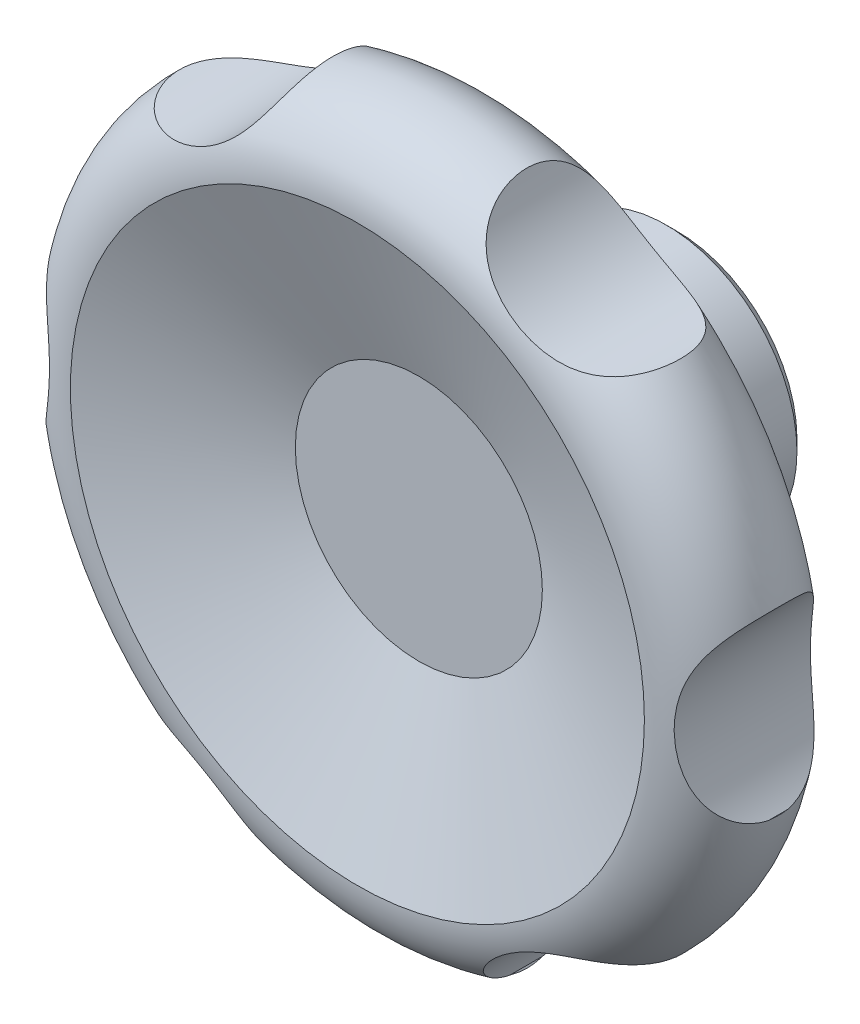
ISO-10303-21;
HEADER;
FILE_DESCRIPTION(('STEP AP214'),'2;1');
FILE_NAME('part.step','',(''),(''),'','','');
FILE_SCHEMA(('AUTOMOTIVE_DESIGN { 1 0 10303 214 1 1 1 1 }'));
ENDSEC;
DATA;
#1=APPLICATION_CONTEXT('core data for automotive mechanical design processes');
#2=APPLICATION_PROTOCOL_DEFINITION('international standard','automotive_design',2000,#1);
#3=PRODUCT_CONTEXT('',#1,'mechanical');
#4=PRODUCT('Part','Part','',(#3));
#5=PRODUCT_RELATED_PRODUCT_CATEGORY('part','',(#4));
#6=PRODUCT_DEFINITION_FORMATION('','',#4);
#7=PRODUCT_DEFINITION_CONTEXT('part definition',#1,'design');
#8=PRODUCT_DEFINITION('design','',#6,#7);
#9=PRODUCT_DEFINITION_SHAPE('','',#8);
#10=(LENGTH_UNIT() NAMED_UNIT(*) SI_UNIT(.MILLI.,.METRE.));
#11=(NAMED_UNIT(*) PLANE_ANGLE_UNIT() SI_UNIT($,.RADIAN.));
#12=(NAMED_UNIT(*) SI_UNIT($,.STERADIAN.) SOLID_ANGLE_UNIT());
#13=UNCERTAINTY_MEASURE_WITH_UNIT(LENGTH_MEASURE(1.E-05),#10,'distance_accuracy_value','');
#14=(GEOMETRIC_REPRESENTATION_CONTEXT(3) GLOBAL_UNCERTAINTY_ASSIGNED_CONTEXT((#13)) GLOBAL_UNIT_ASSIGNED_CONTEXT((#10,
#11,#12)) REPRESENTATION_CONTEXT('',''));
#15=CARTESIAN_POINT('',(0.,0.,0.));
#16=DIRECTION('',(0.,0.,1.));
#17=DIRECTION('',(1.,0.,0.));
#18=AXIS2_PLACEMENT_3D('',#15,#16,#17);
#19=CARTESIAN_POINT('',(0.,0.,34.));
#20=DIRECTION('',(0.,0.,1.));
#21=DIRECTION('',(1.,0.,0.));
#22=AXIS2_PLACEMENT_3D('',#19,#20,#21);
#23=TOROIDAL_SURFACE('',#22,39.5,10.);
#24=CARTESIAN_POINT('',(34.6556326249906,-35.068308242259,35.974473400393));
#25=CARTESIAN_POINT('',(34.6018381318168,-35.0554911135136,36.2076885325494));
#26=CARTESIAN_POINT('',(34.5383708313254,-35.0405674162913,36.4385588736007));
#27=CARTESIAN_POINT('',(34.3924487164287,-35.0073733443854,36.8939715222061));
#28=CARTESIAN_POINT('',(34.3099938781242,-34.9891029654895,37.1185138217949));
#29=CARTESIAN_POINT('',(34.1266245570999,-34.9501180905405,37.5592236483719));
#30=CARTESIAN_POINT('',(34.0257444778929,-34.9294081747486,37.7754058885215));
#31=CARTESIAN_POINT('',(33.8059911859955,-34.8866052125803,38.1982690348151));
#32=CARTESIAN_POINT('',(33.6871187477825,-34.8645122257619,38.4049503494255));
#33=CARTESIAN_POINT('',(33.4319998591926,-34.8201314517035,38.80758856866));
#34=CARTESIAN_POINT('',(33.2957348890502,-34.7978434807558,39.0035337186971));
#35=CARTESIAN_POINT('',(33.0069263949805,-34.7544131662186,39.3831724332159));
#36=CARTESIAN_POINT('',(32.8543826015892,-34.7332708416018,39.5668657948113));
#37=CARTESIAN_POINT('',(32.5343418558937,-34.69350120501,39.9208363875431));
#38=CARTESIAN_POINT('',(32.3668528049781,-34.674872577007,40.0911206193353));
#39=CARTESIAN_POINT('',(32.0183168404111,-34.6414550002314,40.4175932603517));
#40=CARTESIAN_POINT('',(31.837269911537,-34.6266660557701,40.5737816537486));
#41=CARTESIAN_POINT('',(31.4628650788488,-34.6021600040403,40.8719170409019));
#42=CARTESIAN_POINT('',(31.2694816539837,-34.5924538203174,41.0138328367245));
#43=CARTESIAN_POINT('',(30.8725383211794,-34.5792944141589,41.2829163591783));
#44=CARTESIAN_POINT('',(30.6689786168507,-34.5758410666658,41.410084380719));
#45=CARTESIAN_POINT('',(30.2534053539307,-34.5761501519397,41.6499463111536));
#46=CARTESIAN_POINT('',(30.0413880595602,-34.579915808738,41.7626337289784));
#47=CARTESIAN_POINT('',(29.6107510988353,-34.5954390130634,41.9740029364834));
#48=CARTESIAN_POINT('',(29.3921300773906,-34.6071982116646,42.072681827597));
#49=CARTESIAN_POINT('',(28.8634166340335,-34.6455948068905,42.2928224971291));
#50=CARTESIAN_POINT('',(28.5510176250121,-34.6762543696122,42.4080818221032));
#51=CARTESIAN_POINT('',(27.9208316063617,-34.755237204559,42.6155070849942));
#52=CARTESIAN_POINT('',(27.6030428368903,-34.8035663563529,42.7076653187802));
#53=CARTESIAN_POINT('',(26.9649632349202,-34.9184778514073,42.8719353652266));
#54=CARTESIAN_POINT('',(26.6446687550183,-34.9850952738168,42.9440081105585));
#55=CARTESIAN_POINT('',(26.0050282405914,-35.1366369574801,43.0707711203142));
#56=CARTESIAN_POINT('',(25.6856822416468,-35.2215618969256,43.1254607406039));
#57=CARTESIAN_POINT('',(24.9547641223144,-35.4378178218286,43.2343532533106));
#58=CARTESIAN_POINT('',(24.5442835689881,-35.5754265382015,43.2834819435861));
#59=CARTESIAN_POINT('',(23.7326417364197,-35.8806558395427,43.3616653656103));
#60=CARTESIAN_POINT('',(23.3314832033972,-36.0482851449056,43.3907142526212));
#61=CARTESIAN_POINT('',(22.5411971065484,-36.4127382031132,43.4319459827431));
#62=CARTESIAN_POINT('',(22.1520844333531,-36.6095964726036,43.444108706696));
#63=CARTESIAN_POINT('',(21.3890930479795,-37.0311018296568,43.4529471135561));
#64=CARTESIAN_POINT('',(21.0152127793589,-37.2557460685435,43.4496243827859));
#65=CARTESIAN_POINT('',(20.2812220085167,-37.7338568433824,43.4269781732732));
#66=CARTESIAN_POINT('',(19.9212978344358,-37.9876018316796,43.4074866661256));
#67=CARTESIAN_POINT('',(19.2218389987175,-38.5200804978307,43.3499730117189));
#68=CARTESIAN_POINT('',(18.8823080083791,-38.7988186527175,43.3119475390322));
#69=CARTESIAN_POINT('',(18.2270353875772,-39.3779607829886,43.2133977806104));
#70=CARTESIAN_POINT('',(17.9112418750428,-39.6783145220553,43.1529243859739));
#71=CARTESIAN_POINT('',(17.3054902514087,-40.2974796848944,43.0039434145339));
#72=CARTESIAN_POINT('',(17.0155174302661,-40.6162804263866,42.915451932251));
#73=CARTESIAN_POINT('',(16.5587305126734,-41.1555074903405,42.740216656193));
#74=CARTESIAN_POINT('',(16.3837470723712,-41.3722346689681,42.6632524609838));
#75=CARTESIAN_POINT('',(16.0470363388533,-41.8093063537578,42.4925308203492));
#76=CARTESIAN_POINT('',(15.8853050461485,-42.0296497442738,42.3987784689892));
#77=CARTESIAN_POINT('',(15.5759779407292,-42.4713487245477,42.1927970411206));
#78=CARTESIAN_POINT('',(15.4283702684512,-42.6927032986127,42.0805836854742));
#79=CARTESIAN_POINT('',(15.1477783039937,-43.1336965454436,41.8361567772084));
#80=CARTESIAN_POINT('',(15.0147942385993,-43.3533351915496,41.7039429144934));
#81=CARTESIAN_POINT('',(14.7626663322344,-43.7896753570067,41.4171405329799));
#82=CARTESIAN_POINT('',(14.6436689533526,-44.0063278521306,41.2623477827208));
#83=CARTESIAN_POINT('',(14.4211450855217,-44.4308007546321,40.9309799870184));
#84=CARTESIAN_POINT('',(14.3176189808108,-44.6386209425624,40.7544044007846));
#85=CARTESIAN_POINT('',(14.125770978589,-45.0416865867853,40.37980372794));
#86=CARTESIAN_POINT('',(14.0374522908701,-45.2369293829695,40.1817741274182));
#87=CARTESIAN_POINT('',(13.8754289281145,-45.611135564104,39.7654252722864));
#88=CARTESIAN_POINT('',(13.8017214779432,-45.7901020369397,39.5471098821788));
#89=CARTESIAN_POINT('',(13.6775254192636,-46.1043043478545,39.1245172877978));
#90=CARTESIAN_POINT('',(13.625223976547,-46.242134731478,38.92269207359));
#91=CARTESIAN_POINT('',(13.5299246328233,-46.5016847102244,38.5068599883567));
#92=CARTESIAN_POINT('',(13.4869259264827,-46.6234056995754,38.2928541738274));
#93=CARTESIAN_POINT('',(13.4095386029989,-46.8490379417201,37.8547080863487));
#94=CARTESIAN_POINT('',(13.3751338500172,-46.9529824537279,37.6305877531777));
#95=CARTESIAN_POINT('',(13.3140917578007,-47.1421209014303,37.1736687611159));
#96=CARTESIAN_POINT('',(13.2874495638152,-47.2273265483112,36.9408756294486));
#97=CARTESIAN_POINT('',(13.2564784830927,-47.3284100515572,36.6242115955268));
#98=CARTESIAN_POINT('',(13.2490180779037,-47.3529624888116,36.5433325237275));
#99=CARTESIAN_POINT('',(13.2349042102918,-47.3997385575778,36.380945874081));
#100=CARTESIAN_POINT('',(13.2282497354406,-47.4219651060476,36.2994392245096));
#101=CARTESIAN_POINT('',(13.2219808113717,-47.4430353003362,36.2175948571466));
#102=B_SPLINE_CURVE_WITH_KNOTS('',3,(#24,#25,#26,#27,#28,#29,#30,#31,#32,#33,#34,#35,#36,#37,
#38,#39,#40,#41,#42,#43,#44,#45,#46,#47,#48,#49,#50,#51,#52,#53,#54,#55,#56,#57,#58,#59,#60,#61,
#62,#63,#64,#65,#66,#67,#68,#69,#70,#71,#72,#73,#74,#75,#76,#77,#78,#79,#80,#81,#82,#83,#84,#85,
#86,#87,#88,#89,#90,#91,#92,#93,#94,#95,#96,#97,#98,#99,#100,#101),.UNSPECIFIED.,.F.,.F.,(4,2,2,
2,2,2,2,2,2,2,2,2,2,2,2,2,2,2,2,2,2,2,2,2,2,2,2,2,2,2,2,2,2,2,2,2,2,2,4),(0.,0.718836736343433,
1.43767437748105,2.15518328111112,2.8726613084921,3.59090978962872,4.30917016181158,
5.02705302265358,5.744936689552,6.46435691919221,7.18376276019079,7.903489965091,
8.62336587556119,9.62503644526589,10.6270406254,11.6309803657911,12.6349573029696,
13.9403117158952,15.2460459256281,16.5533345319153,17.8604892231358,19.1814007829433,
20.5025494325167,21.8207210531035,23.1381368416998,24.0043919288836,24.8703846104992,
25.7356436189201,26.600916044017,27.4745657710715,28.3482371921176,29.2220927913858,
30.0957822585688,30.8446222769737,31.5933974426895,32.3407559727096,33.0876460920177,
33.3421751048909,33.5963809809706),.UNSPECIFIED.);
#103=CARTESIAN_POINT('',(34.6554326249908,-35.068260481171,35.9753398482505));
#104=VERTEX_POINT('',#103);
#105=CARTESIAN_POINT('',(13.2220403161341,-47.4428353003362,36.218371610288));
#106=VERTEX_POINT('',#105);
#107=EDGE_CURVE('E133',#104,#106,#102,.T.);
#108=ORIENTED_EDGE('',*,*,#107,.F.);
#109=CARTESIAN_POINT('',(32.9935617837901,-32.82108048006,41.1038433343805));
#110=CARTESIAN_POINT('',(33.1234534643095,-32.9605306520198,40.9152033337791));
#111=CARTESIAN_POINT('',(33.244961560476,-33.0974299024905,40.7189958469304));
#112=CARTESIAN_POINT('',(33.4719260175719,-33.3638414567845,40.3128902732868));
#113=CARTESIAN_POINT('',(33.5773886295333,-33.4933566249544,40.1029975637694));
#114=CARTESIAN_POINT('',(33.7731376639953,-33.7429036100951,39.6706842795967));
#115=CARTESIAN_POINT('',(33.8634147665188,-33.8629295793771,39.448256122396));
#116=CARTESIAN_POINT('',(34.0295692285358,-34.0913902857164,38.992315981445));
#117=CARTESIAN_POINT('',(34.1054449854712,-34.1998237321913,38.758802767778));
#118=CARTESIAN_POINT('',(34.2458186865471,-34.4064413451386,38.2744755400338));
#119=CARTESIAN_POINT('',(34.3098766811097,-34.5041884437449,38.0233472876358));
#120=CARTESIAN_POINT('',(34.4243792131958,-34.6834313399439,37.5123388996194));
#121=CARTESIAN_POINT('',(34.4748238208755,-34.7649272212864,37.252458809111));
#122=CARTESIAN_POINT('',(34.5628019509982,-34.909956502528,36.7258528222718));
#123=CARTESIAN_POINT('',(34.6003472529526,-34.9735062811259,36.4591334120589));
#124=CARTESIAN_POINT('',(34.6631865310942,-35.0813938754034,35.920414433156));
#125=CARTESIAN_POINT('',(34.6884806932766,-35.1257319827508,35.6484149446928));
#126=CARTESIAN_POINT('',(34.7272687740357,-35.1942583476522,35.1007016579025));
#127=CARTESIAN_POINT('',(34.7407478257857,-35.2184212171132,34.8249836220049));
#128=CARTESIAN_POINT('',(34.7560875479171,-35.2459498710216,34.2721842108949));
#129=CARTESIAN_POINT('',(34.7579481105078,-35.2493154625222,33.995102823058));
#130=CARTESIAN_POINT('',(34.7500797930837,-35.2351640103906,33.4413654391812));
#131=CARTESIAN_POINT('',(34.7403394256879,-35.2176262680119,33.164710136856));
#132=CARTESIAN_POINT('',(34.7090783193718,-35.1620390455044,32.6141506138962));
#133=CARTESIAN_POINT('',(34.6875578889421,-35.1239901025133,32.3402463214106));
#134=CARTESIAN_POINT('',(34.6328978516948,-35.0291569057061,31.8023579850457));
#135=CARTESIAN_POINT('',(34.5999889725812,-34.9727459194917,31.5382844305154));
#136=CARTESIAN_POINT('',(34.5219644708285,-34.8421907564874,31.0163909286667));
#137=CARTESIAN_POINT('',(34.4768482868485,-34.7680457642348,30.7585712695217));
#138=CARTESIAN_POINT('',(34.3737919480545,-34.6035423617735,30.2510048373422));
#139=CARTESIAN_POINT('',(34.3158609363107,-34.5131955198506,30.0012524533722));
#140=CARTESIAN_POINT('',(34.1863768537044,-34.3180068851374,29.5111511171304));
#141=CARTESIAN_POINT('',(34.1148252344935,-34.2131666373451,29.2708011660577));
#142=CARTESIAN_POINT('',(34.0360674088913,-34.101946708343,29.0358867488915));
#143=B_SPLINE_CURVE_WITH_KNOTS('',3,(#109,#110,#111,#112,#113,#114,#115,#116,#117,#118,#119,
#120,#121,#122,#123,#124,#125,#126,#127,#128,#129,#130,#131,#132,#133,#134,#135,#136,#137,#138,
#139,#140,#141,#142),.UNSPECIFIED.,.F.,.F.,(4,2,2,2,2,2,2,2,2,2,2,2,2,2,2,2,4),(0.,
0.804105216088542,1.60789636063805,2.41217903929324,3.21655116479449,4.04657211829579,
4.87658879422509,5.70584548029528,6.5350895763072,7.36537560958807,8.19566934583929,
9.02678593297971,9.85788075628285,10.6730381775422,11.488233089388,12.3028482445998,
13.1173766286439),.UNSPECIFIED.);
#144=CARTESIAN_POINT('',(34.6554326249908,-35.068260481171,32.024660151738));
#145=VERTEX_POINT('',#144);
#146=EDGE_CURVE('E164',#145,#104,#143,.F.);
#147=ORIENTED_EDGE('',*,*,#146,.F.);
#148=CARTESIAN_POINT('',(13.2219808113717,-47.4430353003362,31.782405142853));
#149=CARTESIAN_POINT('',(13.2397555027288,-47.3833879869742,31.5505422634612));
#150=CARTESIAN_POINT('',(13.2606026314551,-47.3143555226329,31.3213274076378));
#151=CARTESIAN_POINT('',(13.3090486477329,-47.158345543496,30.8698263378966));
#152=CARTESIAN_POINT('',(13.3366474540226,-47.0713682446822,30.6475400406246));
#153=CARTESIAN_POINT('',(13.3991361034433,-46.8805000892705,30.2119970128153));
#154=CARTESIAN_POINT('',(13.4340099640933,-46.7766464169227,29.9987217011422));
#155=CARTESIAN_POINT('',(13.5117609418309,-46.5530169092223,29.5822255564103));
#156=CARTESIAN_POINT('',(13.5546377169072,-46.4332417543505,29.3790042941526));
#157=CARTESIAN_POINT('',(13.6491161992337,-46.1789924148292,28.9838088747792));
#158=CARTESIAN_POINT('',(13.700726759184,-46.0445033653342,28.7918463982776));
#159=CARTESIAN_POINT('',(13.8132688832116,-45.7625352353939,28.4206120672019));
#160=CARTESIAN_POINT('',(13.8742006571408,-45.6150558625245,28.2413404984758));
#161=CARTESIAN_POINT('',(14.005877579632,-45.3090103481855,27.8965496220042));
#162=CARTESIAN_POINT('',(14.0766182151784,-45.1504493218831,27.731024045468));
#163=CARTESIAN_POINT('',(14.2283142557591,-44.8241746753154,27.4143110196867));
#164=CARTESIAN_POINT('',(14.3092697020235,-44.6564610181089,27.2631236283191));
#165=CARTESIAN_POINT('',(14.4820551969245,-44.3130778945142,26.9746831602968));
#166=CARTESIAN_POINT('',(14.5739395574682,-44.1373716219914,26.8375065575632));
#167=CARTESIAN_POINT('',(14.7682767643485,-43.7809522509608,26.5779891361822));
#168=CARTESIAN_POINT('',(14.8707294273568,-43.6002392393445,26.4556480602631));
#169=CARTESIAN_POINT('',(15.0861292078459,-43.235761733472,26.2254055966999));
#170=CARTESIAN_POINT('',(15.1990813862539,-43.0519958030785,26.1175112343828));
#171=CARTESIAN_POINT('',(15.4351781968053,-42.6833756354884,25.9155911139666));
#172=CARTESIAN_POINT('',(15.5583249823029,-42.498521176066,25.8215682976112));
#173=CARTESIAN_POINT('',(15.8680250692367,-42.0522365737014,25.6099513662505));
#174=CARTESIAN_POINT('',(16.0595562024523,-41.79111482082,25.4989455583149));
#175=CARTESIAN_POINT('',(16.4611002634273,-41.2742587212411,25.3002570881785));
#176=CARTESIAN_POINT('',(16.6711197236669,-41.0185263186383,25.212582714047));
#177=CARTESIAN_POINT('',(17.1086318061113,-40.5152123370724,25.0572774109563));
#178=CARTESIAN_POINT('',(17.3361580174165,-40.2676477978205,24.9896862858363));
#179=CARTESIAN_POINT('',(17.8069048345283,-39.7836644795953,24.8717328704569));
#180=CARTESIAN_POINT('',(18.0501258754,-39.5472460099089,24.8213710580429));
#181=CARTESIAN_POINT('',(18.6220737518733,-39.0220943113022,24.7228992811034));
#182=CARTESIAN_POINT('',(18.9554757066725,-38.7375586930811,24.6794857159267));
#183=CARTESIAN_POINT('',(19.6434196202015,-38.1927263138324,24.6120401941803));
#184=CARTESIAN_POINT('',(19.9979673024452,-37.9324361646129,24.5880135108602));
#185=CARTESIAN_POINT('',(20.7261264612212,-37.4379180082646,24.5565575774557));
#186=CARTESIAN_POINT('',(21.0997610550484,-37.2037227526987,24.5491489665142));
#187=CARTESIAN_POINT('',(21.8631591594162,-36.7634232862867,24.5500803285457));
#188=CARTESIAN_POINT('',(22.2529210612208,-36.557316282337,24.5584187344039));
#189=CARTESIAN_POINT('',(23.0493159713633,-36.1728706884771,24.5920030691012));
#190=CARTESIAN_POINT('',(23.4560639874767,-35.9947823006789,24.6173917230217));
#191=CARTESIAN_POINT('',(24.2802270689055,-35.6696013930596,24.6882110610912));
#192=CARTESIAN_POINT('',(24.6976442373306,-35.5225150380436,24.7336457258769));
#193=CARTESIAN_POINT('',(25.5379445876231,-35.2606044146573,24.8491408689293));
#194=CARTESIAN_POINT('',(25.960809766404,-35.1456932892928,24.9191338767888));
#195=CARTESIAN_POINT('',(26.8077965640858,-34.9480794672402,25.0898511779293));
#196=CARTESIAN_POINT('',(27.2319171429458,-34.8653550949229,25.1905547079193));
#197=CARTESIAN_POINT('',(27.9204170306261,-34.7560691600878,25.3857482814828));
#198=CARTESIAN_POINT('',(28.1865080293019,-34.7200317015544,25.4690494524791));
#199=CARTESIAN_POINT('',(28.7142305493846,-34.6603126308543,25.6524245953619));
#200=CARTESIAN_POINT('',(28.9758634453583,-34.6366271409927,25.7524932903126));
#201=CARTESIAN_POINT('',(29.4920325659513,-34.6009675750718,25.9708339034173));
#202=CARTESIAN_POINT('',(29.7465742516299,-34.5889842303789,26.0890913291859));
#203=CARTESIAN_POINT('',(30.2460386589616,-34.5757082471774,26.3450322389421));
#204=CARTESIAN_POINT('',(30.4909611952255,-34.5744158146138,26.4827160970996));
#205=CARTESIAN_POINT('',(30.9703271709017,-34.5812077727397,26.7794488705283));
#206=CARTESIAN_POINT('',(31.2046626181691,-34.5893727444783,26.9386710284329));
#207=CARTESIAN_POINT('',(31.6576136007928,-34.6134761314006,27.2776318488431));
#208=CARTESIAN_POINT('',(31.8762287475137,-34.6294147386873,27.4573710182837));
#209=CARTESIAN_POINT('',(32.29500740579,-34.6670446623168,27.8368251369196));
#210=CARTESIAN_POINT('',(32.495164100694,-34.6887380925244,28.0365474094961));
#211=CARTESIAN_POINT('',(32.8744472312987,-34.7356639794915,28.4546461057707));
#212=CARTESIAN_POINT('',(33.0535770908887,-34.7608958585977,28.6730194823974));
#213=CARTESIAN_POINT('',(33.3673159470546,-34.8093347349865,29.0975329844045));
#214=CARTESIAN_POINT('',(33.5046885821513,-34.8323869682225,29.3016557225));
#215=CARTESIAN_POINT('',(33.7608983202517,-34.8780482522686,29.7212621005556));
#216=CARTESIAN_POINT('',(33.8797367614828,-34.9006573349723,29.9367449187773));
#217=CARTESIAN_POINT('',(34.0978856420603,-34.9440838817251,30.3770269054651));
#218=CARTESIAN_POINT('',(34.1972321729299,-34.9649046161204,30.6018079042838));
#219=CARTESIAN_POINT('',(34.3760785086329,-35.0036593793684,31.0592578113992));
#220=CARTESIAN_POINT('',(34.4555903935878,-35.0215951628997,31.29192182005));
#221=CARTESIAN_POINT('',(34.5492551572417,-35.0432278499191,31.6099437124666));
#222=CARTESIAN_POINT('',(34.5722742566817,-35.0485965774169,31.6926546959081));
#223=CARTESIAN_POINT('',(34.6158155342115,-35.0588330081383,31.8586500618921));
#224=CARTESIAN_POINT('',(34.6363408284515,-35.0637013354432,31.9419335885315));
#225=CARTESIAN_POINT('',(34.6556326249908,-35.068308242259,32.0255265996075));
#226=B_SPLINE_CURVE_WITH_KNOTS('',3,(#148,#149,#150,#151,#152,#153,#154,#155,#156,#157,#158,
#159,#160,#161,#162,#163,#164,#165,#166,#167,#168,#169,#170,#171,#172,#173,#174,#175,#176,#177,
#178,#179,#180,#181,#182,#183,#184,#185,#186,#187,#188,#189,#190,#191,#192,#193,#194,#195,#196,
#197,#198,#199,#200,#201,#202,#203,#204,#205,#206,#207,#208,#209,#210,#211,#212,#213,#214,#215,
#216,#217,#218,#219,#220,#221,#222,#223,#224,#225),.UNSPECIFIED.,.F.,.F.,(4,2,2,2,2,2,2,2,2,2,2,
2,2,2,2,2,2,2,2,2,2,2,2,2,2,2,2,2,2,2,2,2,2,2,2,2,2,2,4),(0.,0.720002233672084,1.4399958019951,
2.15842397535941,2.87682145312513,3.59595151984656,4.315097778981,5.03391425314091,
5.75273362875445,6.4752874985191,7.19782883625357,7.92072027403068,8.64376479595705,
9.66921354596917,10.6950260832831,11.7228583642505,12.7507191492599,14.0703222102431,
15.3902840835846,16.7118844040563,18.0333532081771,19.3660240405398,20.6989596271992,
22.0282614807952,23.3566665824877,24.1994038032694,25.0418763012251,25.8836809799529,
26.7255018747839,27.57454852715,28.423616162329,29.2729961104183,30.12223755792,
30.8626708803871,31.6030507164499,32.3420464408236,33.080590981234,33.3386281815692,
33.5963395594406),.UNSPECIFIED.);
#227=CARTESIAN_POINT('',(13.2220403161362,-47.4428353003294,31.781628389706));
#228=VERTEX_POINT('',#227);
#229=EDGE_CURVE('E158',#228,#145,#226,.T.);
#230=ORIENTED_EDGE('',*,*,#229,.F.);
#231=CARTESIAN_POINT('',(11.8594805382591,-43.9428658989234,41.988665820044));
#232=CARTESIAN_POINT('',(11.9035192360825,-44.1408660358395,41.8361313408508));
#233=CARTESIAN_POINT('',(11.9511477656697,-44.3319398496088,41.6757684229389));
#234=CARTESIAN_POINT('',(12.051501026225,-44.6993691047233,41.3406712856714));
#235=CARTESIAN_POINT('',(12.1042223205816,-44.8757343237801,41.1659467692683));
#236=CARTESIAN_POINT('',(12.2126522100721,-45.2128683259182,40.803505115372));
#237=CARTESIAN_POINT('',(12.268355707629,-45.3736624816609,40.6158099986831));
#238=CARTESIAN_POINT('',(12.3808476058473,-45.6795582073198,40.2282959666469));
#239=CARTESIAN_POINT('',(12.4376362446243,-45.8246562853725,40.0284743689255));
#240=CARTESIAN_POINT('',(12.5564076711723,-46.1134930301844,39.5958588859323));
#241=CARTESIAN_POINT('',(12.6182947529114,-46.2554189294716,39.3618265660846));
#242=CARTESIAN_POINT('',(12.738541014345,-46.5192682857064,38.8818767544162));
#243=CARTESIAN_POINT('',(12.796899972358,-46.6411904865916,38.6359585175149));
#244=CARTESIAN_POINT('',(12.9078091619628,-46.8648565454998,38.1336690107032));
#245=CARTESIAN_POINT('',(12.9603560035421,-46.966588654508,37.8772917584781));
#246=CARTESIAN_POINT('',(13.0575059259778,-47.1495842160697,37.3558747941));
#247=CARTESIAN_POINT('',(13.1021091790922,-47.2308481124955,37.0908352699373));
#248=CARTESIAN_POINT('',(13.1816110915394,-47.3728178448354,36.5535349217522));
#249=CARTESIAN_POINT('',(13.2164982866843,-47.4334994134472,36.2812659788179));
#250=CARTESIAN_POINT('',(13.2750468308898,-47.5340203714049,35.7317119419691));
#251=CARTESIAN_POINT('',(13.2987082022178,-47.5738598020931,35.4544268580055));
#252=CARTESIAN_POINT('',(13.3337880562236,-47.6325647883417,34.8970545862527));
#253=CARTESIAN_POINT('',(13.3452144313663,-47.6514438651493,34.6169693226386));
#254=CARTESIAN_POINT('',(13.3553582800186,-47.6682156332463,34.0559443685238));
#255=CARTESIAN_POINT('',(13.3540760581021,-47.666108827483,33.7750046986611));
#256=CARTESIAN_POINT('',(13.3390625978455,-47.6412516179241,33.221852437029));
#257=CARTESIAN_POINT('',(13.3256622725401,-47.6190499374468,32.9496059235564));
#258=CARTESIAN_POINT('',(13.2874207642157,-47.5548310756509,32.4082791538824));
#259=CARTESIAN_POINT('',(13.2625797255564,-47.5128141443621,32.1391988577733));
#260=CARTESIAN_POINT('',(13.2024291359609,-47.4090346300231,31.6058483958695));
#261=CARTESIAN_POINT('',(13.1671113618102,-47.3472565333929,31.3415821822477));
#262=CARTESIAN_POINT('',(13.0874024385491,-47.2041069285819,30.8198122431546));
#263=CARTESIAN_POINT('',(13.0430110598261,-47.1227349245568,30.5623086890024));
#264=CARTESIAN_POINT('',(12.9464307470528,-46.9397461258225,30.0534199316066));
#265=CARTESIAN_POINT('',(12.8941755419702,-46.8379545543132,29.8021101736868));
#266=CARTESIAN_POINT('',(12.7841815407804,-46.6147893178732,29.3095981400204));
#267=CARTESIAN_POINT('',(12.7264428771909,-46.4934161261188,29.0683956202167));
#268=CARTESIAN_POINT('',(12.6077191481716,-46.2313734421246,28.5977053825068));
#269=CARTESIAN_POINT('',(12.5467357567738,-46.0907138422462,28.3682117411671));
#270=CARTESIAN_POINT('',(12.4238822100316,-45.7903554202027,27.9222386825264));
#271=CARTESIAN_POINT('',(12.3620118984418,-45.6306532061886,27.7057615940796));
#272=CARTESIAN_POINT('',(12.3009029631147,-45.4616069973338,27.496549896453));
#273=B_SPLINE_CURVE_WITH_KNOTS('',3,(#231,#232,#233,#234,#235,#236,#237,#238,#239,#240,#241,
#242,#243,#244,#245,#246,#247,#248,#249,#250,#251,#252,#253,#254,#255,#256,#257,#258,#259,#260,
#261,#262,#263,#264,#265,#266,#267,#268,#269,#270,#271,#272),.UNSPECIFIED.,.F.,.F.,(4,2,2,2,2,2,
2,2,2,2,2,2,2,2,2,2,2,2,2,2,4),(0.,0.761028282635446,1.52154656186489,2.28080397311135,
3.04022994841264,3.88105690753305,4.72193664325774,5.56330427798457,6.40465366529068,
7.24699161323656,8.08932789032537,8.93112047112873,9.7728928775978,10.5923506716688,
11.41179812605,12.2318904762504,13.052003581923,13.8794612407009,14.7068989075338,
15.5339137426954,16.3610761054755),.UNSPECIFIED.);
#274=EDGE_CURVE('E140',#106,#228,#273,.T.);
#275=ORIENTED_EDGE('',*,*,#274,.F.);
#276=EDGE_LOOP('',(#108,#147,#230,#275));
#277=FACE_BOUND('',#276,.T.);
#278=CARTESIAN_POINT('',(47.9026758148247,-12.12301580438,35.3170341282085));
#279=CARTESIAN_POINT('',(47.9326618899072,-12.1229892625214,35.0983841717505));
#280=CARTESIAN_POINT('',(47.9551796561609,-12.1229076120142,34.8787084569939));
#281=CARTESIAN_POINT('',(47.9851177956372,-12.1227582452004,34.4393520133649));
#282=CARTESIAN_POINT('',(47.9926075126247,-12.1226904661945,34.2196760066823));
#283=CARTESIAN_POINT('',(47.9926075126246,-12.1226904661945,33.7803239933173));
#284=CARTESIAN_POINT('',(47.9851177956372,-12.1227582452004,33.5606479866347));
#285=CARTESIAN_POINT('',(47.9551796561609,-12.1229076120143,33.1212915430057));
#286=CARTESIAN_POINT('',(47.9326618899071,-12.1229892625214,32.9016158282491));
#287=CARTESIAN_POINT('',(47.9026758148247,-12.12301580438,32.682965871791));
#288=B_SPLINE_CURVE_WITH_KNOTS('',3,(#278,#279,#280,#281,#282,#283,#284,#285,#286,#287),
.UNSPECIFIED.,.F.,.F.,(4,2,2,2,4),(0.,0.66196433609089,1.32086708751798,1.97976983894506,
2.64173417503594),.UNSPECIFIED.);
#289=CARTESIAN_POINT('',(47.9028758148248,-12.123015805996,35.3155739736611));
#290=VERTEX_POINT('',#289);
#291=CARTESIAN_POINT('',(47.9028758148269,-12.1230158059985,32.6844260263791));
#292=VERTEX_POINT('',#291);
#293=EDGE_CURVE('E165',#290,#292,#288,.T.);
#294=ORIENTED_EDGE('',*,*,#293,.F.);
#295=CARTESIAN_POINT('',(47.9030651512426,-12.123215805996,32.686180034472));
#296=CARTESIAN_POINT('',(47.8778299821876,-12.0965140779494,32.4518580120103));
#297=CARTESIAN_POINT('',(47.8458229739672,-12.0625858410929,32.2190873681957));
#298=CARTESIAN_POINT('',(47.7689687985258,-11.980156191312,31.7582918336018));
#299=CARTESIAN_POINT('',(47.7241214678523,-11.9316545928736,31.5302670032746));
#300=CARTESIAN_POINT('',(47.6223543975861,-11.8200284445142,31.0808927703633));
#301=CARTESIAN_POINT('',(47.565449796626,-11.7569222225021,30.8595353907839));
#302=CARTESIAN_POINT('',(47.4405326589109,-11.6159589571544,30.4248039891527));
#303=CARTESIAN_POINT('',(47.3725205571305,-11.5381024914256,30.2114296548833));
#304=CARTESIAN_POINT('',(47.2265170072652,-11.3675156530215,29.7939564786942));
#305=CARTESIAN_POINT('',(47.1485148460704,-11.2747692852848,29.5898679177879));
#306=CARTESIAN_POINT('',(46.9840247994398,-11.0745463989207,29.1926285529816));
#307=CARTESIAN_POINT('',(46.8975368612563,-10.9670697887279,28.9994778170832));
#308=CARTESIAN_POINT('',(46.7177585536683,-10.7376976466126,28.6254791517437));
#309=CARTESIAN_POINT('',(46.6244724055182,-10.6158110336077,28.444623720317));
#310=CARTESIAN_POINT('',(46.4328227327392,-10.3579926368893,28.096105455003));
#311=CARTESIAN_POINT('',(46.3344592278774,-10.2220609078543,27.9284425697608));
#312=CARTESIAN_POINT('',(46.134758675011,-9.93712961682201,27.6074447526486));
#313=CARTESIAN_POINT('',(46.03342956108,-9.7881631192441,27.4540754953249));
#314=CARTESIAN_POINT('',(45.8294263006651,-9.47769055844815,27.1616209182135));
#315=CARTESIAN_POINT('',(45.7267521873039,-9.31618480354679,27.0225352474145));
#316=CARTESIAN_POINT('',(45.5218138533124,-8.98153298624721,26.7586813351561));
#317=CARTESIAN_POINT('',(45.4195497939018,-8.80838274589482,26.6339182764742));
#318=CARTESIAN_POINT('',(45.2171248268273,-8.45155398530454,26.3985171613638));
#319=CARTESIAN_POINT('',(45.116964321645,-8.26787347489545,26.2878817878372));
#320=CARTESIAN_POINT('',(44.8880614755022,-7.82945675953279,26.0462606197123));
#321=CARTESIAN_POINT('',(44.7606892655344,-7.57113452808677,25.9204592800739));
#322=CARTESIAN_POINT('',(44.5152487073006,-7.04058532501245,25.6910767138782));
#323=CARTESIAN_POINT('',(44.3971829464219,-6.76835452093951,25.5875016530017));
#324=CARTESIAN_POINT('',(44.1724522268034,-6.21203723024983,25.4001838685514));
#325=CARTESIAN_POINT('',(44.0658075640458,-5.92793084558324,25.3164761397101));
#326=CARTESIAN_POINT('',(43.8658420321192,-5.35057476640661,25.1667143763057));
#327=CARTESIAN_POINT('',(43.7725218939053,-5.05732457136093,25.1006613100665));
#328=CARTESIAN_POINT('',(43.5728207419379,-4.36846460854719,24.9651071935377));
#329=CARTESIAN_POINT('',(43.4718355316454,-3.97016390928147,24.9012826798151));
#330=CARTESIAN_POINT('',(43.2969679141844,-3.16478737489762,24.7954491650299));
#331=CARTESIAN_POINT('',(43.2230942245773,-2.7577087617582,24.7534471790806));
#332=CARTESIAN_POINT('',(43.1033990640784,-1.93755529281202,24.687549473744));
#333=CARTESIAN_POINT('',(43.057609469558,-1.52447416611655,24.6636743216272));
#334=CARTESIAN_POINT('',(42.9947286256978,-0.695589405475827,24.6317848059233));
#335=CARTESIAN_POINT('',(42.9776344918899,-0.279786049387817,24.6237688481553));
#336=CARTESIAN_POINT('',(42.9722580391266,0.558586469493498,24.6227591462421));
#337=CARTESIAN_POINT('',(42.9844342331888,0.981158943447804,24.6300042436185));
#338=CARTESIAN_POINT('',(43.0384307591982,1.82388564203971,24.6607711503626));
#339=CARTESIAN_POINT('',(43.0802549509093,2.24403954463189,24.6842950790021));
#340=CARTESIAN_POINT('',(43.1929874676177,3.07846236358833,24.7499558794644));
#341=CARTESIAN_POINT('',(43.2638602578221,3.49273783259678,24.792070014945));
#342=CARTESIAN_POINT('',(43.4336848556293,4.31251913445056,24.8987319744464));
#343=CARTESIAN_POINT('',(43.5326264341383,4.71802810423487,24.9632716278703));
#344=CARTESIAN_POINT('',(43.7264371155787,5.40835885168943,25.0986391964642));
#345=CARTESIAN_POINT('',(43.8151776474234,5.69617408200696,25.1630515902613));
#346=CARTESIAN_POINT('',(44.005504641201,6.26315060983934,25.3087109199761));
#347=CARTESIAN_POINT('',(44.1070879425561,6.54231401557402,25.3899537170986));
#348=CARTESIAN_POINT('',(44.3214135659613,7.08951903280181,25.5714073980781));
#349=CARTESIAN_POINT('',(44.4341393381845,7.35757632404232,25.6715903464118));
#350=CARTESIAN_POINT('',(44.6687882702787,7.88062797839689,25.8931165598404));
#351=CARTESIAN_POINT('',(44.7907097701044,8.13562468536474,26.0144560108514));
#352=CARTESIAN_POINT('',(45.0194735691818,8.58742651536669,26.257115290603));
#353=CARTESIAN_POINT('',(45.1252932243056,8.78668648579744,26.3748342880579));
#354=CARTESIAN_POINT('',(45.3395468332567,9.17310479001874,26.6265899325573));
#355=CARTESIAN_POINT('',(45.4479802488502,9.36026558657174,26.7606232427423));
#356=CARTESIAN_POINT('',(45.6654078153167,9.72114775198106,27.0453061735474));
#357=CARTESIAN_POINT('',(45.7744019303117,9.89486996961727,27.1959547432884));
#358=CARTESIAN_POINT('',(45.9907280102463,10.22768386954,27.5137425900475));
#359=CARTESIAN_POINT('',(46.0980599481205,10.3867753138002,27.6808821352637));
#360=CARTESIAN_POINT('',(46.3091880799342,10.6899523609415,28.0317927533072));
#361=CARTESIAN_POINT('',(46.4129679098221,10.8339735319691,28.2156294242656));
#362=CARTESIAN_POINT('',(46.6142268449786,11.1055141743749,28.598341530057));
#363=CARTESIAN_POINT('',(46.7117058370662,11.2330333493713,28.7972172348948));
#364=CARTESIAN_POINT('',(46.8982087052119,11.4711032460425,29.2086619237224));
#365=CARTESIAN_POINT('',(46.9872315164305,11.5816518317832,29.4212326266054));
#366=CARTESIAN_POINT('',(47.1548593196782,11.7855209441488,29.8583946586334));
#367=CARTESIAN_POINT('',(47.2334648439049,11.8788423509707,30.0829853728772));
#368=CARTESIAN_POINT('',(47.3733123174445,12.0420529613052,30.525633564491));
#369=CARTESIAN_POINT('',(47.4354011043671,12.1131523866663,30.7429791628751));
#370=CARTESIAN_POINT('',(47.5480907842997,12.2405609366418,31.1848543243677));
#371=CARTESIAN_POINT('',(47.5986922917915,12.2968708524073,31.4093835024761));
#372=CARTESIAN_POINT('',(47.6875391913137,12.3948067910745,31.8640037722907));
#373=CARTESIAN_POINT('',(47.7257852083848,12.4364335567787,32.0940945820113));
#374=CARTESIAN_POINT('',(47.7892886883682,12.5051230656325,32.5582114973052));
#375=CARTESIAN_POINT('',(47.8145459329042,12.532185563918,32.7922376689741));
#376=CARTESIAN_POINT('',(47.8516585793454,12.5718359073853,33.2625581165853));
#377=CARTESIAN_POINT('',(47.8635144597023,12.5844242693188,33.4988523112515));
#378=CARTESIAN_POINT('',(47.8736355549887,12.5951752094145,33.972057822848));
#379=CARTESIAN_POINT('',(47.8719008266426,12.5933378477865,34.2089691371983));
#380=CARTESIAN_POINT('',(47.854868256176,12.575230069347,34.681759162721));
#381=CARTESIAN_POINT('',(47.8395699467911,12.5589591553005,34.9176378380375));
#382=CARTESIAN_POINT('',(47.7956560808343,12.5119238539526,35.3866968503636));
#383=CARTESIAN_POINT('',(47.7670404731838,12.4811594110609,35.61987717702));
#384=CARTESIAN_POINT('',(47.6967270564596,12.4047839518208,36.0834233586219));
#385=CARTESIAN_POINT('',(47.6549435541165,12.3590756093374,36.3137602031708));
#386=CARTESIAN_POINT('',(47.5590661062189,12.2527525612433,36.7683536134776));
#387=CARTESIAN_POINT('',(47.5049721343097,12.1921378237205,36.9926101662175));
#388=CARTESIAN_POINT('',(47.3854333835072,12.0559154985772,37.4333619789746));
#389=CARTESIAN_POINT('',(47.3199908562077,11.9803108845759,37.6498587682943));
#390=CARTESIAN_POINT('',(47.1789319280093,11.8140629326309,38.0735628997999));
#391=CARTESIAN_POINT('',(47.1033156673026,11.7234198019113,38.2807703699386));
#392=CARTESIAN_POINT('',(46.944093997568,11.528113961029,38.6824770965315));
#393=CARTESIAN_POINT('',(46.860572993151,11.4235954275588,38.8770799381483));
#394=CARTESIAN_POINT('',(46.6865012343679,11.2000917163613,39.25446811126));
#395=CARTESIAN_POINT('',(46.5959505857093,11.0811067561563,39.4372536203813));
#396=CARTESIAN_POINT('',(46.4095534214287,10.8290847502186,39.7899181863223));
#397=CARTESIAN_POINT('',(46.3137078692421,10.6960502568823,39.9597995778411));
#398=CARTESIAN_POINT('',(46.118518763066,10.4164981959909,40.28590011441));
#399=CARTESIAN_POINT('',(46.0191751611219,10.2699804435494,40.4421190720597));
#400=CARTESIAN_POINT('',(45.8179277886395,9.962860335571,40.7417513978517));
#401=CARTESIAN_POINT('',(45.7160090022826,9.8021427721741,40.8850364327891));
#402=CARTESIAN_POINT('',(45.5123340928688,9.46874827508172,41.1570289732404));
#403=CARTESIAN_POINT('',(45.4105779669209,9.29607155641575,41.2857367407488));
#404=CARTESIAN_POINT('',(45.2089333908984,8.93981189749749,41.5287717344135));
#405=CARTESIAN_POINT('',(45.1090452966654,8.75622690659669,41.6430962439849));
#406=CARTESIAN_POINT('',(44.9126959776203,8.37932167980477,41.8578227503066));
#407=CARTESIAN_POINT('',(44.8162354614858,8.18599945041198,41.9582218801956));
#408=CARTESIAN_POINT('',(44.5919918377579,7.71492530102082,42.1817999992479));
#409=CARTESIAN_POINT('',(44.4663956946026,7.43324566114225,42.2989332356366));
#410=CARTESIAN_POINT('',(44.2272822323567,6.85648304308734,42.510290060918));
#411=CARTESIAN_POINT('',(44.1137688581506,6.56139573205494,42.6045061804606));
#412=CARTESIAN_POINT('',(43.900759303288,5.95997664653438,42.7729305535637));
#413=CARTESIAN_POINT('',(43.8012917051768,5.65362349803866,42.8470982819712));
#414=CARTESIAN_POINT('',(43.6181505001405,5.03262879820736,42.9779406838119));
#415=CARTESIAN_POINT('',(43.5344775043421,4.71798692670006,43.0346146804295));
#416=CARTESIAN_POINT('',(43.3615387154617,3.98781979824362,43.1476854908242));
#417=CARTESIAN_POINT('',(43.2780173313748,3.57013474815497,43.198981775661));
#418=CARTESIAN_POINT('',(43.1406405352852,2.72789347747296,43.2810187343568));
#419=CARTESIAN_POINT('',(43.0867937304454,2.3033353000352,43.3117534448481));
#420=CARTESIAN_POINT('',(43.0094295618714,1.45008633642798,43.3557665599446));
#421=CARTESIAN_POINT('',(42.985947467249,1.02139132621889,43.3690246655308));
#422=CARTESIAN_POINT('',(42.9696989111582,0.163277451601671,43.379451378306));
#423=CARTESIAN_POINT('',(42.9769293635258,-0.266141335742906,43.3766216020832));
#424=CARTESIAN_POINT('',(43.0222696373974,-1.12754377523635,43.354449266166));
#425=CARTESIAN_POINT('',(43.0607088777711,-1.55950574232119,43.3349304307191));
#426=CARTESIAN_POINT('',(43.1684575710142,-2.41840442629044,43.2770236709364));
#427=CARTESIAN_POINT('',(43.2377723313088,-2.84534026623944,43.2386325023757));
#428=CARTESIAN_POINT('',(43.4061224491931,-3.68971122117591,43.1392880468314));
#429=CARTESIAN_POINT('',(43.5050923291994,-4.10716510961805,43.0783843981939));
#430=CARTESIAN_POINT('',(43.7310378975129,-4.92927588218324,42.9288205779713));
#431=CARTESIAN_POINT('',(43.8579981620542,-5.33393967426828,42.8401756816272));
#432=CARTESIAN_POINT('',(44.0900659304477,-5.99268272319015,42.6644668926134));
#433=CARTESIAN_POINT('',(44.1882271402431,-6.25175843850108,42.5868387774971));
#434=CARTESIAN_POINT('',(44.3942115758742,-6.76028631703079,42.4147928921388));
#435=CARTESIAN_POINT('',(44.5020319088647,-7.0097413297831,42.3203801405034));
#436=CARTESIAN_POINT('',(44.7255390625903,-7.49698307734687,42.1131104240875));
#437=CARTESIAN_POINT('',(44.8412198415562,-7.73477853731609,42.0002675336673));
#438=CARTESIAN_POINT('',(45.0783328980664,-8.19688559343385,41.7546491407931));
#439=CARTESIAN_POINT('',(45.1997652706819,-8.42119696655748,41.6218733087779));
#440=CARTESIAN_POINT('',(45.4469477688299,-8.85642391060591,41.3340081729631));
#441=CARTESIAN_POINT('',(45.5727286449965,-9.06718574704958,41.1787119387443));
#442=CARTESIAN_POINT('',(45.8243375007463,-9.4709007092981,40.8464398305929));
#443=CARTESIAN_POINT('',(45.9501654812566,-9.66385346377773,40.6694635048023));
#444=CARTESIAN_POINT('',(46.1984673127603,-10.0302198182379,40.2942451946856));
#445=CARTESIAN_POINT('',(46.3209416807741,-10.2036364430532,40.096006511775));
#446=CARTESIAN_POINT('',(46.559105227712,-10.5296452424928,39.6793777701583));
#447=CARTESIAN_POINT('',(46.6747956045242,-10.6822410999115,39.4609912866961));
#448=CARTESIAN_POINT('',(46.8801009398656,-10.9452650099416,39.0387887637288));
#449=CARTESIAN_POINT('',(46.9710675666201,-11.0585999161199,38.8374311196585));
#450=CARTESIAN_POINT('',(47.1437718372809,-11.2691534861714,38.4226974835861));
#451=CARTESIAN_POINT('',(47.2255102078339,-11.3663734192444,38.2093224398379));
#452=CARTESIAN_POINT('',(47.3780479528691,-11.5445254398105,37.7723538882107));
#453=CARTESIAN_POINT('',(47.4488563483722,-11.6254709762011,37.5487690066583));
#454=CARTESIAN_POINT('',(47.578215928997,-11.771188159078,37.0930471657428));
#455=CARTESIAN_POINT('',(47.636771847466,-11.8359660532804,36.8609135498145));
#456=CARTESIAN_POINT('',(47.7358380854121,-11.9443506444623,36.411230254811));
#457=CARTESIAN_POINT('',(47.7775032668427,-11.9893444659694,36.194266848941));
#458=CARTESIAN_POINT('',(47.8491416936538,-12.0661083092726,35.7566035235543));
#459=CARTESIAN_POINT('',(47.8791398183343,-12.0979064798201,35.5359126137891));
#460=CARTESIAN_POINT('',(47.9030651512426,-12.123215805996,35.3138199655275));
#461=B_SPLINE_CURVE_WITH_KNOTS('',3,(#295,#296,#297,#298,#299,#300,#301,#302,#303,#304,#305,
#306,#307,#308,#309,#310,#311,#312,#313,#314,#315,#316,#317,#318,#319,#320,#321,#322,#323,#324,
#325,#326,#327,#328,#329,#330,#331,#332,#333,#334,#335,#336,#337,#338,#339,#340,#341,#342,#343,
#344,#345,#346,#347,#348,#349,#350,#351,#352,#353,#354,#355,#356,#357,#358,#359,#360,#361,#362,
#363,#364,#365,#366,#367,#368,#369,#370,#371,#372,#373,#374,#375,#376,#377,#378,#379,#380,#381,
#382,#383,#384,#385,#386,#387,#388,#389,#390,#391,#392,#393,#394,#395,#396,#397,#398,#399,#400,
#401,#402,#403,#404,#405,#406,#407,#408,#409,#410,#411,#412,#413,#414,#415,#416,#417,#418,#419,
#420,#421,#422,#423,#424,#425,#426,#427,#428,#429,#430,#431,#432,#433,#434,#435,#436,#437,#438,
#439,#440,#441,#442,#443,#444,#445,#446,#447,#448,#449,#450,#451,#452,#453,#454,#455,#456,#457,
#458,#459,#460),.UNSPECIFIED.,.F.,.F.,(4,2,2,2,2,2,2,2,2,2,2,2,2,2,2,2,2,2,2,2,2,2,2,2,2,2,2,2,
2,2,2,2,2,2,2,2,2,2,2,2,2,2,2,2,2,2,2,2,2,2,2,2,2,2,2,2,2,2,2,2,2,2,2,2,2,2,2,2,2,2,2,2,2,2,2,2,
2,2,2,2,2,2,4),(0.,0.711347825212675,1.42270470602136,2.13317367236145,2.84361482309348,
3.55482431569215,4.26603822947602,4.97681422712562,5.68758745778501,6.3966072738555,
7.10560966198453,7.81486780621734,8.5242604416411,9.4657460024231,10.407492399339,
11.3508854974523,12.2943303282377,13.5400674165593,14.7862047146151,16.0337538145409,
17.2811775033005,18.5482687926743,19.8155250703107,21.0812357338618,22.346485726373,
23.2697262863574,24.1927400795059,25.1144029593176,26.0358998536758,26.7985793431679,
27.5611030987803,28.3235786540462,29.0860666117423,29.851691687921,30.6173305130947,
31.383065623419,32.1487615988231,32.8587968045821,33.5687940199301,34.2787553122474,
34.9887285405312,35.6986764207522,36.4086213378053,37.1185907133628,37.8285628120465,
38.5432541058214,39.2579469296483,39.9724981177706,40.6870394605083,41.3946652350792,
42.1022803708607,42.8097671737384,43.5172636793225,44.2311470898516,44.9450176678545,
45.6590228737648,46.3731748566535,47.3614134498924,48.3499737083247,49.3405175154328,
50.3310996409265,51.6164400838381,52.902153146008,54.1893582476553,55.4764340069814,
56.7772746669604,58.0783390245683,59.3765515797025,60.6740505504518,61.5365006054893,
62.398693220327,63.2602304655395,64.1217819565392,64.9918208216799,65.8618778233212,
66.7317999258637,67.6015679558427,68.3455853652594,69.0895441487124,69.8328855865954,
70.5759393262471,71.251614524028,71.925840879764),.UNSPECIFIED.);
#462=EDGE_CURVE('E221',#292,#290,#461,.T.);
#463=ORIENTED_EDGE('',*,*,#462,.F.);
#464=EDGE_LOOP('',(#294,#463));
#465=FACE_BOUND('',#464,.T.);
#466=CARTESIAN_POINT('',(0.,0.,24.));
#467=DIRECTION('',(0.,0.,1.));
#468=DIRECTION('',(1.,0.,0.));
#469=AXIS2_PLACEMENT_3D('',#466,#467,#468);
#470=CIRCLE('',#469,39.5000019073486);
#471=CARTESIAN_POINT('',(39.5000019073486,0.,24.));
#472=VERTEX_POINT('',#471);
#473=EDGE_CURVE('E203',#472,#472,#470,.T.);
#474=ORIENTED_EDGE('',*,*,#473,.T.);
#475=EDGE_LOOP('',(#474));
#476=FACE_BOUND('',#475,.T.);
#477=CARTESIAN_POINT('',(0.,0.,44.));
#478=DIRECTION('',(0.,0.,1.));
#479=DIRECTION('',(1.,0.,0.));
#480=AXIS2_PLACEMENT_3D('',#477,#478,#479);
#481=CIRCLE('',#480,39.5);
#482=CARTESIAN_POINT('',(39.5,0.,44.));
#483=VERTEX_POINT('',#482);
#484=EDGE_CURVE('E200',#483,#483,#481,.T.);
#485=ORIENTED_EDGE('',*,*,#484,.F.);
#486=EDGE_LOOP('',(#485));
#487=FACE_BOUND('',#486,.T.);
#488=CARTESIAN_POINT('',(17.7589156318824,40.338958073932,42.89206727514));
#489=CARTESIAN_POINT('',(18.0540840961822,40.0443649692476,42.9696081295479));
#490=CARTESIAN_POINT('',(18.3613955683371,39.7581694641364,43.0332328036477));
#491=CARTESIAN_POINT('',(18.9977090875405,39.2061574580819,43.1375558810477));
#492=CARTESIAN_POINT('',(19.3267278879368,38.9403570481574,43.1782363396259));
#493=CARTESIAN_POINT('',(20.0050839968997,38.4309051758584,43.2403444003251));
#494=CARTESIAN_POINT('',(20.3544912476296,38.1873383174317,43.2617010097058));
#495=CARTESIAN_POINT('',(21.0700526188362,37.7254160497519,43.286992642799));
#496=CARTESIAN_POINT('',(21.4362027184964,37.5070546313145,43.2909318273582));
#497=CARTESIAN_POINT('',(22.1772892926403,37.1000379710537,43.2818676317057));
#498=CARTESIAN_POINT('',(22.5520103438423,36.9109848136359,43.2691185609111));
#499=CARTESIAN_POINT('',(23.3129814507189,36.5598215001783,43.2258709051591));
#500=CARTESIAN_POINT('',(23.6992332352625,36.3977154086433,43.1953696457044));
#501=CARTESIAN_POINT('',(24.4793779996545,36.1017406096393,43.1139209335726));
#502=CARTESIAN_POINT('',(24.8732526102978,35.9678114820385,43.0630179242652));
#503=CARTESIAN_POINT('',(25.6656528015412,35.7284574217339,42.9366400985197));
#504=CARTESIAN_POINT('',(26.0641763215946,35.6230203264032,42.8611757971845));
#505=CARTESIAN_POINT('',(26.74434728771,35.4674955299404,42.7069815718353));
#506=CARTESIAN_POINT('',(27.0260579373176,35.410240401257,42.6356742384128));
#507=CARTESIAN_POINT('',(27.5872087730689,35.3099179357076,42.4762053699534));
#508=CARTESIAN_POINT('',(27.866649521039,35.2668469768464,42.388048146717));
#509=CARTESIAN_POINT('',(28.4203870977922,35.1945317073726,42.1930468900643));
#510=CARTESIAN_POINT('',(28.6946901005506,35.1652696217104,42.0862271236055));
#511=CARTESIAN_POINT('',(29.2355399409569,35.1197563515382,41.8520860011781));
#512=CARTESIAN_POINT('',(29.5020879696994,35.1035031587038,41.724767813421));
#513=CARTESIAN_POINT('',(29.9829941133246,35.0844757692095,41.4701107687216));
#514=CARTESIAN_POINT('',(30.1989603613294,35.0799818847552,41.3459331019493));
#515=CARTESIAN_POINT('',(30.6209406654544,35.0784675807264,41.081670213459));
#516=CARTESIAN_POINT('',(30.8269565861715,35.0814457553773,40.9415879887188));
#517=CARTESIAN_POINT('',(31.2269694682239,35.0937259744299,40.645426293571));
#518=CARTESIAN_POINT('',(31.420966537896,35.1030279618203,40.4893469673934));
#519=CARTESIAN_POINT('',(31.7949388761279,35.1266210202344,40.1615209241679));
#520=CARTESIAN_POINT('',(31.9749138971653,35.1409121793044,39.9897739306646));
#521=CARTESIAN_POINT('',(32.3196068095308,35.1730755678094,39.6307301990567));
#522=CARTESIAN_POINT('',(32.4842692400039,35.1909601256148,39.4433812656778));
#523=CARTESIAN_POINT('',(32.7960285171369,35.2287409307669,39.0547737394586));
#524=CARTESIAN_POINT('',(32.9431250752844,35.2486372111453,38.8535149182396));
#525=CARTESIAN_POINT('',(33.2184604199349,35.2889262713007,38.4384926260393));
#526=CARTESIAN_POINT('',(33.3466966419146,35.3093191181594,38.2247274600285));
#527=CARTESIAN_POINT('',(33.5832710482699,35.3491749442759,37.786380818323));
#528=CARTESIAN_POINT('',(33.6916100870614,35.3686379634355,37.5617998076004));
#529=CARTESIAN_POINT('',(33.8814410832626,35.4042072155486,37.1181552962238));
#530=CARTESIAN_POINT('',(33.9641985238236,35.4204479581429,36.8996426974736));
#531=CARTESIAN_POINT('',(34.1111812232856,35.4501301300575,36.4562949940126));
#532=CARTESIAN_POINT('',(34.1754073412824,35.4635716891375,36.2314601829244));
#533=CARTESIAN_POINT('',(34.2850392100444,35.4869605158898,35.7770834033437));
#534=CARTESIAN_POINT('',(34.330445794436,35.4969079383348,35.5475416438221));
#535=CARTESIAN_POINT('',(34.4022653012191,35.5128120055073,35.0853667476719));
#536=CARTESIAN_POINT('',(34.4286779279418,35.5187685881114,34.8527335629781));
#537=CARTESIAN_POINT('',(34.4624424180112,35.5264053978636,34.3856243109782));
#538=CARTESIAN_POINT('',(34.4697620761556,35.5280783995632,34.1511457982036));
#539=CARTESIAN_POINT('',(34.4652228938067,35.5270457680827,33.6823847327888));
#540=CARTESIAN_POINT('',(34.4533641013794,35.5243401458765,33.448102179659));
#541=CARTESIAN_POINT('',(34.4105084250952,35.5146819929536,32.9813784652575));
#542=CARTESIAN_POINT('',(34.3795113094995,35.5077294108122,32.7489373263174));
#543=CARTESIAN_POINT('',(34.2984919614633,35.4899203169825,32.2875450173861));
#544=CARTESIAN_POINT('',(34.2484697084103,35.4790638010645,32.0585938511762));
#545=CARTESIAN_POINT('',(34.1293528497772,35.4539426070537,31.6048626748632));
#546=CARTESIAN_POINT('',(34.0601788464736,35.4396637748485,31.3801042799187));
#547=CARTESIAN_POINT('',(33.9031749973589,35.4084761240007,30.9373871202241));
#548=CARTESIAN_POINT('',(33.8153451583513,35.3915673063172,30.7194283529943));
#549=CARTESIAN_POINT('',(33.6215291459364,35.3560582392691,30.2919394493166));
#550=CARTESIAN_POINT('',(33.5155470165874,35.3374583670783,30.0824074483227));
#551=CARTESIAN_POINT('',(33.2860791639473,35.2996519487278,29.6732179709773));
#552=CARTESIAN_POINT('',(33.1625936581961,35.2804454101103,29.4735603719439));
#553=CARTESIAN_POINT('',(32.9002004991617,35.2428017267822,29.0872449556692));
#554=CARTESIAN_POINT('',(32.761443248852,35.2243591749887,28.9004854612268));
#555=CARTESIAN_POINT('',(32.468694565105,35.1892987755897,28.5391416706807));
#556=CARTESIAN_POINT('',(32.3147033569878,35.1726809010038,28.3645571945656));
#557=CARTESIAN_POINT('',(31.9928100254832,35.1425218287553,28.0284886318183));
#558=CARTESIAN_POINT('',(31.8249096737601,35.1289802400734,27.8670028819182));
#559=CARTESIAN_POINT('',(31.4766750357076,35.1061767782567,27.5577277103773));
#560=CARTESIAN_POINT('',(31.2963404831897,35.0969149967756,27.4099385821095));
#561=CARTESIAN_POINT('',(30.921183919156,35.0836515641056,27.1255720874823));
#562=CARTESIAN_POINT('',(30.7261452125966,35.0797581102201,26.9892759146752));
#563=CARTESIAN_POINT('',(30.3266667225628,35.0786082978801,26.7312524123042));
#564=CARTESIAN_POINT('',(30.1222270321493,35.0813518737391,26.6095249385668));
#565=CARTESIAN_POINT('',(29.7057098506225,35.0943310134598,26.380274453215));
#566=CARTESIAN_POINT('',(29.4936303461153,35.1045685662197,26.2727552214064));
#567=CARTESIAN_POINT('',(29.0636168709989,35.1332006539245,26.0713398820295));
#568=CARTESIAN_POINT('',(28.8456816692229,35.1515969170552,25.9774466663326));
#569=CARTESIAN_POINT('',(28.3128117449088,35.2066315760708,25.7655998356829));
#570=CARTESIAN_POINT('',(27.9957143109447,35.2476908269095,25.6541884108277));
#571=CARTESIAN_POINT('',(27.3571635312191,35.3481693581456,25.454514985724));
#572=CARTESIAN_POINT('',(27.03570868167,35.4075951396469,25.3662612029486));
#573=CARTESIAN_POINT('',(26.3912802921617,35.545275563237,25.2097878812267));
#574=CARTESIAN_POINT('',(26.0683049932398,35.6235682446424,25.1416094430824));
#575=CARTESIAN_POINT('',(25.4242947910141,35.7988919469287,25.0226793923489));
#576=CARTESIAN_POINT('',(25.1032599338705,35.8959234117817,24.9719281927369));
#577=CARTESIAN_POINT('',(24.3806872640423,36.1367019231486,24.8738440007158));
#578=CARTESIAN_POINT('',(23.9803870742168,36.2860131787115,24.8309897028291));
#579=CARTESIAN_POINT('',(23.190023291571,36.6134441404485,24.7652756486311));
#580=CARTESIAN_POINT('',(22.7999623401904,36.7915711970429,24.74242100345));
#581=CARTESIAN_POINT('',(22.0325913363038,37.1757483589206,24.7144469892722));
#582=CARTESIAN_POINT('',(21.6552975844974,37.3818325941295,24.7093495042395));
#583=CARTESIAN_POINT('',(20.9165804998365,37.8203796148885,24.7164244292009));
#584=CARTESIAN_POINT('',(20.555155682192,38.0528399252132,24.7285952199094));
#585=CARTESIAN_POINT('',(19.847982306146,38.5442613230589,24.7716026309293));
#586=CARTESIAN_POINT('',(19.5023680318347,38.8034041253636,24.8025753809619));
#587=CARTESIAN_POINT('',(18.832123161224,39.3445435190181,24.8863299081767));
#588=CARTESIAN_POINT('',(18.5074966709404,39.6265445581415,24.9391159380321));
#589=CARTESIAN_POINT('',(17.8829252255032,40.2093114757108,25.0708763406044));
#590=CARTESIAN_POINT('',(17.5829108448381,40.5100200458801,25.1497736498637));
#591=CARTESIAN_POINT('',(17.0095402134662,41.1263276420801,25.33948494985));
#592=CARTESIAN_POINT('',(16.7361655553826,41.4419161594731,25.4502766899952));
#593=CARTESIAN_POINT('',(16.3141741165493,41.9637947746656,25.6620940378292));
#594=CARTESIAN_POINT('',(16.1566612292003,42.1675792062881,25.7517160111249));
#595=CARTESIAN_POINT('',(15.8541464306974,42.5763955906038,25.9476029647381));
#596=CARTESIAN_POINT('',(15.7091406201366,42.7814271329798,26.0538627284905));
#597=CARTESIAN_POINT('',(15.4323187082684,43.1901872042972,26.2842087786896));
#598=CARTESIAN_POINT('',(15.3004943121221,43.3939164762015,26.4082837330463));
#599=CARTESIAN_POINT('',(15.0503820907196,43.7974100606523,26.6751998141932));
#600=CARTESIAN_POINT('',(14.9320946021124,43.9971742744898,26.8180414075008));
#601=CARTESIAN_POINT('',(14.7083950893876,44.3912646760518,27.1241207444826));
#602=CARTESIAN_POINT('',(14.6030946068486,44.5855340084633,27.2875137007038));
#603=CARTESIAN_POINT('',(14.4064423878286,44.9637009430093,27.6336067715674));
#604=CARTESIAN_POINT('',(14.3150908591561,45.1475983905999,27.8163071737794));
#605=CARTESIAN_POINT('',(14.1459925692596,45.5018260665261,28.2002107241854));
#606=CARTESIAN_POINT('',(14.0682447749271,45.6721573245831,28.4014124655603));
#607=CARTESIAN_POINT('',(13.9257203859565,45.9963092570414,28.8209686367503));
#608=CARTESIAN_POINT('',(13.8609423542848,46.1501317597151,29.0393211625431));
#609=CARTESIAN_POINT('',(13.7506014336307,46.4212753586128,29.4640578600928));
#610=CARTESIAN_POINT('',(13.7036632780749,46.5407612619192,29.6687087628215));
#611=CARTESIAN_POINT('',(13.6185192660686,46.763503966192,30.0883826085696));
#612=CARTESIAN_POINT('',(13.5803126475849,46.8667621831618,30.3034046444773));
#613=CARTESIAN_POINT('',(13.5119814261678,47.0558386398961,30.7421954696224));
#614=CARTESIAN_POINT('',(13.4818561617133,47.1416583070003,30.9659635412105));
#615=CARTESIAN_POINT('',(13.4290745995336,47.2949286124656,31.4205619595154));
#616=CARTESIAN_POINT('',(13.4064183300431,47.3623791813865,31.6513923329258));
#617=CARTESIAN_POINT('',(13.3686988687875,47.4762770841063,32.1105437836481));
#618=CARTESIAN_POINT('',(13.3534073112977,47.5233507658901,32.3386910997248));
#619=CARTESIAN_POINT('',(13.3289627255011,47.599253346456,32.7983186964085));
#620=CARTESIAN_POINT('',(13.3198095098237,47.628082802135,33.0297988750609));
#621=CARTESIAN_POINT('',(13.3074151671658,47.6672433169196,33.4944725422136));
#622=CARTESIAN_POINT('',(13.3041739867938,47.6775745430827,33.727666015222));
#623=CARTESIAN_POINT('',(13.3035211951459,47.6796501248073,34.194146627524));
#624=CARTESIAN_POINT('',(13.3061096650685,47.6713942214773,34.427433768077));
#625=CARTESIAN_POINT('',(13.3172313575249,47.636210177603,34.8945421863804));
#626=CARTESIAN_POINT('',(13.3258172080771,47.6091167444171,35.1283497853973));
#627=CARTESIAN_POINT('',(13.3492062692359,47.536325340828,35.5927373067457));
#628=CARTESIAN_POINT('',(13.3640095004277,47.4906273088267,35.8233172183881));
#629=CARTESIAN_POINT('',(13.4001864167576,47.3810542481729,36.2795802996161));
#630=CARTESIAN_POINT('',(13.4215597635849,47.3171801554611,36.5052637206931));
#631=CARTESIAN_POINT('',(13.4713467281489,47.1718784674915,36.9501092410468));
#632=CARTESIAN_POINT('',(13.4997602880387,47.0904510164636,37.1692713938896));
#633=CARTESIAN_POINT('',(13.564072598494,46.9111925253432,37.5987512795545));
#634=CARTESIAN_POINT('',(13.5999454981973,46.8134183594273,37.8090966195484));
#635=CARTESIAN_POINT('',(13.6798287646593,46.6023440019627,38.2202338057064));
#636=CARTESIAN_POINT('',(13.7238390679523,46.4890439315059,38.4210257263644));
#637=CARTESIAN_POINT('',(13.8205753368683,46.248268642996,38.8116190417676));
#638=CARTESIAN_POINT('',(13.8732984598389,46.1207980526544,39.0014239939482));
#639=CARTESIAN_POINT('',(13.9880145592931,45.8531985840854,39.3689156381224));
#640=CARTESIAN_POINT('',(14.0500074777,45.7130697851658,39.5466024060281));
#641=CARTESIAN_POINT('',(14.183404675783,45.4225777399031,39.8881052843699));
#642=CARTESIAN_POINT('',(14.2547643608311,45.272264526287,40.0519814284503));
#643=CARTESIAN_POINT('',(14.4074255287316,44.9627197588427,40.366095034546));
#644=CARTESIAN_POINT('',(14.4887269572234,44.8034882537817,40.5163325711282));
#645=CARTESIAN_POINT('',(14.6614596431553,44.4780257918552,40.8028503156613));
#646=CARTESIAN_POINT('',(14.752894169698,44.3117925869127,40.9391259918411));
#647=CARTESIAN_POINT('',(14.9458721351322,43.9743584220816,41.1976194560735));
#648=CARTESIAN_POINT('',(15.0474158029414,43.8031573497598,41.3198369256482));
#649=CARTESIAN_POINT('',(15.2668498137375,43.447355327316,41.5573785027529));
#650=CARTESIAN_POINT('',(15.3853549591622,43.2625659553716,41.6718513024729));
#651=CARTESIAN_POINT('',(15.633237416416,42.8916749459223,41.8859224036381));
#652=CARTESIAN_POINT('',(15.7626157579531,42.7055731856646,41.9855192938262));
#653=CARTESIAN_POINT('',(16.0317401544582,42.3340408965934,42.170680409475));
#654=CARTESIAN_POINT('',(16.1714822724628,42.1486101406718,42.2562499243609));
#655=CARTESIAN_POINT('',(16.4608319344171,41.7800254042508,42.4144448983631));
#656=CARTESIAN_POINT('',(16.6104378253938,41.5968710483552,42.4870725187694));
#657=CARTESIAN_POINT('',(16.9212345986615,41.2315475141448,42.6215212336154));
#658=CARTESIAN_POINT('',(17.0825624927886,41.0494315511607,42.6831694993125));
#659=CARTESIAN_POINT('',(17.4141532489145,40.690219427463,42.7955192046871));
#660=CARTESIAN_POINT('',(17.584412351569,40.5131212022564,42.8462252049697));
#661=CARTESIAN_POINT('',(17.7589156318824,40.338958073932,42.89206727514));
#662=B_SPLINE_CURVE_WITH_KNOTS('',3,(#488,#489,#490,#491,#492,#493,#494,#495,#496,#497,#498,
#499,#500,#501,#502,#503,#504,#505,#506,#507,#508,#509,#510,#511,#512,#513,#514,#515,#516,#517,
#518,#519,#520,#521,#522,#523,#524,#525,#526,#527,#528,#529,#530,#531,#532,#533,#534,#535,#536,
#537,#538,#539,#540,#541,#542,#543,#544,#545,#546,#547,#548,#549,#550,#551,#552,#553,#554,#555,
#556,#557,#558,#559,#560,#561,#562,#563,#564,#565,#566,#567,#568,#569,#570,#571,#572,#573,#574,
#575,#576,#577,#578,#579,#580,#581,#582,#583,#584,#585,#586,#587,#588,#589,#590,#591,#592,#593,
#594,#595,#596,#597,#598,#599,#600,#601,#602,#603,#604,#605,#606,#607,#608,#609,#610,#611,#612,
#613,#614,#615,#616,#617,#618,#619,#620,#621,#622,#623,#624,#625,#626,#627,#628,#629,#630,#631,
#632,#633,#634,#635,#636,#637,#638,#639,#640,#641,#642,#643,#644,#645,#646,#647,#648,#649,#650,
#651,#652,#653,#654,#655,#656,#657,#658,#659,#660,#661),.UNSPECIFIED.,.T.,.F.,(4,2,2,2,2,2,2,2,
2,2,2,2,2,2,2,2,2,2,2,2,2,2,2,2,2,2,2,2,2,2,2,2,2,2,2,2,2,2,2,2,2,2,2,2,2,2,2,2,2,2,2,2,2,2,2,2,
2,2,2,2,2,2,2,2,2,2,2,2,2,2,2,2,2,2,2,2,2,2,2,2,2,2,2,2,2,2,4),(0.,1.27225121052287,
2.54549607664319,3.82339986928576,5.10099836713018,6.35935260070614,7.61789646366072,
8.87371347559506,10.1289935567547,11.0168143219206,11.9044082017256,12.790856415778,
13.6771677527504,14.4238928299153,15.1704774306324,15.9170553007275,16.6636463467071,
17.4128439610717,18.1620538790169,18.9113655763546,19.6606450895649,20.3624857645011,
21.0642938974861,21.7660709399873,22.467858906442,23.1708298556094,23.8737990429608,
24.5767767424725,25.27975520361,25.9856928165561,26.6916301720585,27.3974104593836,
28.1031819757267,28.8025375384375,29.50188275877,30.2011390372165,30.9004102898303,
31.6135787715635,32.3267401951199,33.0400909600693,33.7535928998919,34.7678665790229,
35.7824996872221,36.7991958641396,37.8159161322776,39.1023644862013,40.3891415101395,
41.6775038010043,42.9657452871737,44.263427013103,45.5613618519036,46.8554996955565,
48.1487368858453,48.9661761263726,49.7833595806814,50.6000255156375,51.4167117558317,
52.2399849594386,53.0632704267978,53.8864933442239,54.7096249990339,55.4334696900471,
56.1572511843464,56.8809734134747,57.6046983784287,58.3042471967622,59.0037746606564,
59.7032958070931,60.4028266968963,61.1085744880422,61.8143246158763,62.5200384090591,
63.225746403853,63.9290483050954,64.6323447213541,65.3354121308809,66.0384751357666,
66.7383047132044,67.4381304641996,68.1381826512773,68.8382506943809,69.5802488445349,
70.3223173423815,71.0641053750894,71.8057694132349,72.5582371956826,73.3103907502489),.UNSPECIFIED.);
#663=CARTESIAN_POINT('',(17.7589156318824,40.338958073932,42.89206727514));
#664=VERTEX_POINT('',#663);
#665=EDGE_CURVE('E196',#664,#664,#662,.T.);
#666=ORIENTED_EDGE('',*,*,#665,.F.);
#667=EDGE_LOOP('',(#666));
#668=FACE_BOUND('',#667,.T.);
#669=CARTESIAN_POINT('',(-31.5322199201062,35.107288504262,40.393679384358));
#670=CARTESIAN_POINT('',(-31.3162089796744,35.0951892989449,40.5780834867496));
#671=CARTESIAN_POINT('',(-31.0911909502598,35.0865014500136,40.7522642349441));
#672=CARTESIAN_POINT('',(-30.6261652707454,35.0778870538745,41.0797881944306));
#673=CARTESIAN_POINT('',(-30.3861470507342,35.0779667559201,41.2331164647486));
#674=CARTESIAN_POINT('',(-29.893705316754,35.0885066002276,41.5195550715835));
#675=CARTESIAN_POINT('',(-29.6412496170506,35.0989951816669,41.6526088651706));
#676=CARTESIAN_POINT('',(-29.1276739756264,35.1316141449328,41.898904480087));
#677=CARTESIAN_POINT('',(-28.866555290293,35.1537428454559,42.0121491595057));
#678=CARTESIAN_POINT('',(-28.3411944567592,35.2101881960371,42.2191662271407));
#679=CARTESIAN_POINT('',(-28.0770127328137,35.2443761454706,42.3131282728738));
#680=CARTESIAN_POINT('',(-27.5453372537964,35.3254741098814,42.484655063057));
#681=CARTESIAN_POINT('',(-27.2778434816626,35.372384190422,42.5622197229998));
#682=CARTESIAN_POINT('',(-26.7416674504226,35.4791638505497,42.7026637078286));
#683=CARTESIAN_POINT('',(-26.4729853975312,35.5390312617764,42.7655454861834));
#684=CARTESIAN_POINT('',(-25.9360975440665,35.6717880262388,42.8783372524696));
#685=CARTESIAN_POINT('',(-25.6678918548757,35.7446801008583,42.9282445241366));
#686=CARTESIAN_POINT('',(-25.0023399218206,35.942356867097,43.038340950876));
#687=CARTESIAN_POINT('',(-24.6061651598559,36.0750596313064,43.0915698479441));
#688=CARTESIAN_POINT('',(-23.8220135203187,36.3686313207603,43.1770003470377));
#689=CARTESIAN_POINT('',(-23.4340398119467,36.5295109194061,43.2091939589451));
#690=CARTESIAN_POINT('',(-22.6686147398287,36.8788548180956,43.2554988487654));
#691=CARTESIAN_POINT('',(-22.2911875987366,37.0673772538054,43.2695713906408));
#692=CARTESIAN_POINT('',(-21.5503747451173,37.4705626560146,43.2808750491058));
#693=CARTESIAN_POINT('',(-21.1869873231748,37.6852224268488,43.2781082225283));
#694=CARTESIAN_POINT('',(-20.4732715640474,38.1413825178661,43.255361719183));
#695=CARTESIAN_POINT('',(-20.1230948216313,38.3831124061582,43.2352233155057));
#696=CARTESIAN_POINT('',(-19.4416978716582,38.8899660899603,43.1755513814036));
#697=CARTESIAN_POINT('',(-19.1104808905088,39.1550938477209,43.1360145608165));
#698=CARTESIAN_POINT('',(-18.4702914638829,39.7055496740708,43.0341215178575));
#699=CARTESIAN_POINT('',(-18.1612691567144,39.9908294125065,42.9718184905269));
#700=CARTESIAN_POINT('',(-17.5673751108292,40.5785594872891,42.8195468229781));
#701=CARTESIAN_POINT('',(-17.2824906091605,40.8810006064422,42.7295929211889));
#702=CARTESIAN_POINT('',(-16.8289522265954,41.3964959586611,42.5514424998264));
#703=CARTESIAN_POINT('',(-16.6528879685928,41.6062322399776,42.4723991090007));
#704=CARTESIAN_POINT('',(-16.3137332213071,42.0291393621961,42.2975381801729));
#705=CARTESIAN_POINT('',(-16.1506389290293,42.242309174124,42.2017255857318));
#706=CARTESIAN_POINT('',(-15.8383068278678,42.6695368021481,41.9917442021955));
#707=CARTESIAN_POINT('',(-15.6890592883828,42.8835938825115,41.8775884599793));
#708=CARTESIAN_POINT('',(-15.4049681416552,43.3098686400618,41.6295085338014));
#709=CARTESIAN_POINT('',(-15.2701247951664,43.5220862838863,41.4955839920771));
#710=CARTESIAN_POINT('',(-15.0140707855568,43.9434665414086,41.2056450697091));
#711=CARTESIAN_POINT('',(-14.893007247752,44.1525785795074,41.049426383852));
#712=CARTESIAN_POINT('',(-14.6662539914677,44.5619400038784,40.7156052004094));
#713=CARTESIAN_POINT('',(-14.5605645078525,44.7621892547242,40.5380023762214));
#714=CARTESIAN_POINT('',(-14.364432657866,45.1500308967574,40.1619045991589));
#715=CARTESIAN_POINT('',(-14.27398517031,45.3376275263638,39.9634167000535));
#716=CARTESIAN_POINT('',(-14.1077788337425,45.6966447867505,39.5466597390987));
#717=CARTESIAN_POINT('',(-14.0320177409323,45.8680678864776,39.3283937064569));
#718=CARTESIAN_POINT('',(-13.9043200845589,46.1680867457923,38.9068259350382));
#719=CARTESIAN_POINT('',(-13.8505222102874,46.2992896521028,38.7059338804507));
#720=CARTESIAN_POINT('',(-13.7524097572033,46.5457860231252,38.292429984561));
#721=CARTESIAN_POINT('',(-13.7080941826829,46.6610811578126,38.0798193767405));
#722=CARTESIAN_POINT('',(-13.6282612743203,46.8743059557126,37.6445050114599));
#723=CARTESIAN_POINT('',(-13.5927432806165,46.9722369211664,37.4218020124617));
#724=CARTESIAN_POINT('',(-13.5298261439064,47.1495863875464,36.9680335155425));
#725=CARTESIAN_POINT('',(-13.5024269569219,47.2290049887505,36.7369680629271));
#726=CARTESIAN_POINT('',(-13.4563611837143,47.3648554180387,36.2803825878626));
#727=CARTESIAN_POINT('',(-13.4373177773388,47.4222598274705,36.0551890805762));
#728=CARTESIAN_POINT('',(-13.405570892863,47.5190769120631,35.6005370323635));
#729=CARTESIAN_POINT('',(-13.3928671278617,47.5584904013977,35.3710786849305));
#730=CARTESIAN_POINT('',(-13.3734962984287,47.6189703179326,34.9095174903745));
#731=CARTESIAN_POINT('',(-13.3668289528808,47.6400375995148,34.67741476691));
#732=CARTESIAN_POINT('',(-13.3593636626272,47.6636445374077,34.2121716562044));
#733=CARTESIAN_POINT('',(-13.358565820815,47.6661838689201,33.9790312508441));
#734=CARTESIAN_POINT('',(-13.3628362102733,47.6526588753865,33.5115144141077));
#735=CARTESIAN_POINT('',(-13.3679504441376,47.6364486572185,33.2771426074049));
#736=CARTESIAN_POINT('',(-13.3842506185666,47.5853287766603,32.810659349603));
#737=CARTESIAN_POINT('',(-13.39543657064,47.5504190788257,32.5785479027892));
#738=CARTESIAN_POINT('',(-13.424154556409,47.4622185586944,32.1182479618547));
#739=CARTESIAN_POINT('',(-13.4416864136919,47.4089282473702,31.8900593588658));
#740=CARTESIAN_POINT('',(-13.4834990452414,47.2844715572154,31.4392424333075));
#741=CARTESIAN_POINT('',(-13.5077797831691,47.2133052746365,31.2166140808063));
#742=CARTESIAN_POINT('',(-13.5635677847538,47.0538892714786,30.7787508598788));
#743=CARTESIAN_POINT('',(-13.5950677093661,46.9656569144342,30.5635087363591));
#744=CARTESIAN_POINT('',(-13.6658802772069,46.7729986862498,30.1417332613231));
#745=CARTESIAN_POINT('',(-13.7051928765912,46.6685729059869,29.9351998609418));
#746=CARTESIAN_POINT('',(-13.7922190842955,46.4447309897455,29.5323457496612));
#747=CARTESIAN_POINT('',(-13.8399306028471,46.3253185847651,29.3360225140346));
#748=CARTESIAN_POINT('',(-13.9443384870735,46.0729009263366,28.9548435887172));
#749=CARTESIAN_POINT('',(-14.0010347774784,45.939895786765,28.7699878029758));
#750=CARTESIAN_POINT('',(-14.1234883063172,45.6629131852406,28.4141049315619));
#751=CARTESIAN_POINT('',(-14.1891791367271,45.5190193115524,28.2429898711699));
#752=CARTESIAN_POINT('',(-14.3303067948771,45.2212463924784,27.9139945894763));
#753=CARTESIAN_POINT('',(-14.4057434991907,45.0673674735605,27.7561142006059));
#754=CARTESIAN_POINT('',(-14.5666059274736,44.7515523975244,27.4541382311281));
#755=CARTESIAN_POINT('',(-14.6520311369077,44.589616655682,27.3100419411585));
#756=CARTESIAN_POINT('',(-14.8329651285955,44.2596528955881,27.0358509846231));
#757=CARTESIAN_POINT('',(-14.9284742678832,44.0916246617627,26.9057568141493));
#758=CARTESIAN_POINT('',(-15.1340833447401,43.7436955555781,26.6538917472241));
#759=CARTESIAN_POINT('',(-15.2446491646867,43.5636021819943,26.5327679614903));
#760=CARTESIAN_POINT('',(-15.476493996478,43.2010190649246,26.3053128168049));
#761=CARTESIAN_POINT('',(-15.597773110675,43.0185292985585,26.1989815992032));
#762=CARTESIAN_POINT('',(-15.8507501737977,42.6529880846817,26.000341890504));
#763=CARTESIAN_POINT('',(-15.9824537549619,42.4699363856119,25.9080410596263));
#764=CARTESIAN_POINT('',(-16.2557772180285,42.1050574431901,25.7365960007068));
#765=CARTESIAN_POINT('',(-16.3973992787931,41.9232304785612,25.6574546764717));
#766=CARTESIAN_POINT('',(-16.763047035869,41.4722725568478,25.474835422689));
#767=CARTESIAN_POINT('',(-16.9929484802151,41.2048194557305,25.3789009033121));
#768=CARTESIAN_POINT('',(-17.4721029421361,40.6800036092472,25.21052613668));
#769=CARTESIAN_POINT('',(-17.7213642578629,40.4226452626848,25.1380960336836));
#770=CARTESIAN_POINT('',(-18.2378458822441,39.9206184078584,25.0131028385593));
#771=CARTESIAN_POINT('',(-18.5050960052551,39.6759722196,24.9605737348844));
#772=CARTESIAN_POINT('',(-19.055459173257,39.2020667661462,24.87251607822));
#773=CARTESIAN_POINT('',(-19.3385706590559,38.9728059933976,24.8369858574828));
#774=CARTESIAN_POINT('',(-19.9257661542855,38.5262096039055,24.7799446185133));
#775=CARTESIAN_POINT('',(-20.2301820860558,38.3092676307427,24.758773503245));
#776=CARTESIAN_POINT('',(-20.8523873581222,37.8944919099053,24.7302059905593));
#777=CARTESIAN_POINT('',(-21.1701772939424,37.6966590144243,24.7228102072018));
#778=CARTESIAN_POINT('',(-21.8174728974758,37.3211920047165,24.7212243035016));
#779=CARTESIAN_POINT('',(-22.1469776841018,37.1435563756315,24.7270331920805));
#780=CARTESIAN_POINT('',(-22.8159955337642,36.8093563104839,24.752303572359));
#781=CARTESIAN_POINT('',(-23.1555082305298,36.6527911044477,24.7717645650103));
#782=CARTESIAN_POINT('',(-23.8374295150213,36.3636643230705,24.8253838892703));
#783=CARTESIAN_POINT('',(-24.1797171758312,36.2307763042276,24.8593161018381));
#784=CARTESIAN_POINT('',(-24.8699651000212,35.9867127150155,24.9441173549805));
#785=CARTESIAN_POINT('',(-25.217925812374,35.8755388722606,24.9949877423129));
#786=CARTESIAN_POINT('',(-25.9163097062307,35.6754301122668,25.1166283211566));
#787=CARTESIAN_POINT('',(-26.2667292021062,35.586467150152,25.1873731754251));
#788=CARTESIAN_POINT('',(-26.9669529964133,35.4307117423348,25.3523761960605));
#789=CARTESIAN_POINT('',(-27.3167574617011,35.3639118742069,25.4466264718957));
#790=CARTESIAN_POINT('',(-27.9243961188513,35.2660683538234,25.635412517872));
#791=CARTESIAN_POINT('',(-28.183330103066,35.2302597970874,25.7239691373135));
#792=CARTESIAN_POINT('',(-28.6961692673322,35.1704379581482,25.9179569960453));
#793=CARTESIAN_POINT('',(-28.9500757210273,35.1464216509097,26.0233838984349));
#794=CARTESIAN_POINT('',(-29.4502618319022,35.109497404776,26.2523830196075));
#795=CARTESIAN_POINT('',(-29.6965458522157,35.0965829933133,26.3759446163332));
#796=CARTESIAN_POINT('',(-30.1789127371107,35.0808260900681,26.6422264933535));
#797=CARTESIAN_POINT('',(-30.4149955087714,35.0779836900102,26.7849469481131));
#798=CARTESIAN_POINT('',(-30.8760451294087,35.0810351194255,27.091309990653));
#799=CARTESIAN_POINT('',(-31.100900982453,35.0870030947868,27.2551194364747));
#800=CARTESIAN_POINT('',(-31.5344371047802,35.1061025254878,27.6025819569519));
#801=CARTESIAN_POINT('',(-31.7431170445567,35.1192341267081,27.7862354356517));
#802=CARTESIAN_POINT('',(-32.1415668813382,35.1506962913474,28.1725769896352));
#803=CARTESIAN_POINT('',(-32.3313399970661,35.1690259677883,28.3752618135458));
#804=CARTESIAN_POINT('',(-32.6896570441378,35.2087835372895,28.7983091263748));
#805=CARTESIAN_POINT('',(-32.8582036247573,35.2302110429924,29.0186694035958));
#806=CARTESIAN_POINT('',(-33.1516717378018,35.2711969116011,29.4453663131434));
#807=CARTESIAN_POINT('',(-33.2794159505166,35.2906343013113,29.649780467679));
#808=CARTESIAN_POINT('',(-33.5164592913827,35.3289536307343,30.0690728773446));
#809=CARTESIAN_POINT('',(-33.6257601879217,35.3478356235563,30.2839501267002));
#810=CARTESIAN_POINT('',(-33.8251831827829,35.3838628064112,30.7225416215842));
#811=CARTESIAN_POINT('',(-33.9153067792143,35.4010081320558,30.9462551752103));
#812=CARTESIAN_POINT('',(-34.0758686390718,35.4325539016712,31.4008281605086));
#813=CARTESIAN_POINT('',(-34.1463068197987,35.4469543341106,31.6316876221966));
#814=CARTESIAN_POINT('',(-34.2649985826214,35.4717531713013,32.090477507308));
#815=CARTESIAN_POINT('',(-34.3139511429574,35.4822755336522,32.3182208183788));
#816=CARTESIAN_POINT('',(-34.3930199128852,35.4994846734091,32.7770903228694));
#817=CARTESIAN_POINT('',(-34.4231367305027,35.5061715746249,33.0082164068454));
#818=CARTESIAN_POINT('',(-34.4644245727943,35.5153802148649,33.47222237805));
#819=CARTESIAN_POINT('',(-34.4755966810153,35.5179021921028,33.7051021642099));
#820=CARTESIAN_POINT('',(-34.4789605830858,35.5186592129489,34.1710082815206));
#821=CARTESIAN_POINT('',(-34.4711521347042,35.5168942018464,34.4040346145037));
#822=CARTESIAN_POINT('',(-34.436432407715,35.5091294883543,34.8706006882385));
#823=CARTESIAN_POINT('',(-34.4093579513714,35.5030936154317,35.1041277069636));
#824=CARTESIAN_POINT('',(-34.3360265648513,35.4870492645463,35.5680150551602));
#825=CARTESIAN_POINT('',(-34.2897694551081,35.477040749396,35.7983753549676));
#826=CARTESIAN_POINT('',(-34.1782459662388,35.4535595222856,36.2543280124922));
#827=CARTESIAN_POINT('',(-34.1129750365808,35.4400859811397,36.4799192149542));
#828=CARTESIAN_POINT('',(-33.9637306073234,35.4103880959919,36.9246352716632));
#829=CARTESIAN_POINT('',(-33.8797577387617,35.3941638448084,37.1437603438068));
#830=CARTESIAN_POINT('',(-33.6938065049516,35.3599064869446,37.573379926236));
#831=CARTESIAN_POINT('',(-33.5918773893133,35.3418783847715,37.7838961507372));
#832=CARTESIAN_POINT('',(-33.3704700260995,35.3050213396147,38.1954440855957));
#833=CARTESIAN_POINT('',(-33.2509900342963,35.2861923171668,38.3964748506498));
#834=CARTESIAN_POINT('',(-32.9955299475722,35.2489347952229,38.787330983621));
#835=CARTESIAN_POINT('',(-32.8595767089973,35.2305057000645,38.9771738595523));
#836=CARTESIAN_POINT('',(-32.5721195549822,35.1952641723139,39.3447391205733));
#837=CARTESIAN_POINT('',(-32.4206223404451,35.1784510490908,39.5224666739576));
#838=CARTESIAN_POINT('',(-32.14742691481,35.1519703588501,39.8173175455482));
#839=CARTESIAN_POINT('',(-32.0291407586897,35.1416152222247,39.9375618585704));
#840=CARTESIAN_POINT('',(-31.7857013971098,35.1228685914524,40.1709653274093));
#841=CARTESIAN_POINT('',(-31.6605501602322,35.1144765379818,40.2841264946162));
#842=CARTESIAN_POINT('',(-31.5322199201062,35.107288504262,40.393679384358));
#843=B_SPLINE_CURVE_WITH_KNOTS('',3,(#669,#670,#671,#672,#673,#674,#675,#676,#677,#678,#679,
#680,#681,#682,#683,#684,#685,#686,#687,#688,#689,#690,#691,#692,#693,#694,#695,#696,#697,#698,
#699,#700,#701,#702,#703,#704,#705,#706,#707,#708,#709,#710,#711,#712,#713,#714,#715,#716,#717,
#718,#719,#720,#721,#722,#723,#724,#725,#726,#727,#728,#729,#730,#731,#732,#733,#734,#735,#736,
#737,#738,#739,#740,#741,#742,#743,#744,#745,#746,#747,#748,#749,#750,#751,#752,#753,#754,#755,
#756,#757,#758,#759,#760,#761,#762,#763,#764,#765,#766,#767,#768,#769,#770,#771,#772,#773,#774,
#775,#776,#777,#778,#779,#780,#781,#782,#783,#784,#785,#786,#787,#788,#789,#790,#791,#792,#793,
#794,#795,#796,#797,#798,#799,#800,#801,#802,#803,#804,#805,#806,#807,#808,#809,#810,#811,#812,
#813,#814,#815,#816,#817,#818,#819,#820,#821,#822,#823,#824,#825,#826,#827,#828,#829,#830,#831,
#832,#833,#834,#835,#836,#837,#838,#839,#840,#841,#842),.UNSPECIFIED.,.T.,.F.,(4,2,2,2,2,2,2,2,
2,2,2,2,2,2,2,2,2,2,2,2,2,2,2,2,2,2,2,2,2,2,2,2,2,2,2,2,2,2,2,2,2,2,2,2,2,2,2,2,2,2,2,2,2,2,2,2,
2,2,2,2,2,2,2,2,2,2,2,2,2,2,2,2,2,2,2,2,2,2,2,2,2,2,2,2,2,2,4),(0.,0.85262060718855,
1.705848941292,2.56141490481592,3.41685732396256,4.26343340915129,5.11001385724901,
5.95645274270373,6.80306869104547,8.06486917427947,9.32714866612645,10.5921219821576,
11.8569407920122,13.1334403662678,14.4101565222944,15.6839084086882,16.9569825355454,
17.8113348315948,18.6654356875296,19.5189317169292,20.3724431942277,21.2343492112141,
22.0962683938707,22.957897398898,23.8193946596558,24.5561449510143,25.2928178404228,
26.0294354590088,26.7660490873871,27.464756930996,28.1634331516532,28.8620768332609,
29.5607327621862,30.264861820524,30.9689922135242,31.6731030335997,32.3772100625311,
33.0806044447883,33.7839948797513,34.4872105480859,35.1904203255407,35.8886931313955,
36.5869570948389,37.2851851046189,37.9834378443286,38.7134290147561,39.4434271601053,
40.1738224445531,40.9043786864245,41.9992297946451,43.0945528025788,44.1917381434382,
45.2888158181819,46.411032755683,47.5332997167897,48.6554824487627,49.7776241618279,
50.8828397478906,51.9881432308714,53.09204394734,54.1955745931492,55.0228240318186,
55.8498611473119,56.6764157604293,57.5029779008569,58.336535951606,59.17011097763,
60.003543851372,60.8368726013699,61.5614563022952,62.28597048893,63.0104280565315,
63.7348886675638,64.4336227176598,65.1323342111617,65.8310057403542,66.5296861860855,
67.2343557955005,67.9390320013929,68.6438769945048,69.3486982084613,70.0516155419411,
70.7546027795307,71.4564589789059,72.1580138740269,72.6646929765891,73.1712275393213),.UNSPECIFIED.);
#844=CARTESIAN_POINT('',(-31.5322199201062,35.107288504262,40.393679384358));
#845=VERTEX_POINT('',#844);
#846=EDGE_CURVE('E166',#845,#845,#843,.T.);
#847=ORIENTED_EDGE('',*,*,#846,.F.);
#848=EDGE_LOOP('',(#847));
#849=FACE_BOUND('',#848,.T.);
#850=CARTESIAN_POINT('',(-47.9538708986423,-12.123215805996,34.8643758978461));
#851=CARTESIAN_POINT('',(-47.9372973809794,-12.1056613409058,35.0996016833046));
#852=CARTESIAN_POINT('',(-47.9138933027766,-12.080915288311,35.3338101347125));
#853=CARTESIAN_POINT('',(-47.8539796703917,-12.0169309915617,35.798545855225));
#854=CARTESIAN_POINT('',(-47.817469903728,-11.9776925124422,36.0290730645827));
#855=CARTESIAN_POINT('',(-47.7319388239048,-11.8846559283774,36.4845912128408));
#856=CARTESIAN_POINT('',(-47.6829285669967,-11.8308706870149,36.7095868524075));
#857=CARTESIAN_POINT('',(-47.5732274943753,-11.7086140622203,37.1526259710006));
#858=CARTESIAN_POINT('',(-47.5125370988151,-11.6401432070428,37.3706696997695));
#859=CARTESIAN_POINT('',(-47.3804648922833,-11.4883636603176,37.7984688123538));
#860=CARTESIAN_POINT('',(-47.3090719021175,-11.4050394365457,38.0082152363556));
#861=CARTESIAN_POINT('',(-47.1569359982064,-11.2236156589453,38.4176879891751));
#862=CARTESIAN_POINT('',(-47.0761930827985,-11.1255161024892,38.6174143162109));
#863=CARTESIAN_POINT('',(-46.906914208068,-10.9147530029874,39.0053679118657));
#864=CARTESIAN_POINT('',(-46.8183832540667,-10.8020987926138,39.193602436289));
#865=CARTESIAN_POINT('',(-46.6351607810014,-10.5624904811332,39.5575461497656));
#866=CARTESIAN_POINT('',(-46.5404693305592,-10.4355365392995,39.7332554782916));
#867=CARTESIAN_POINT('',(-46.3471858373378,-10.1684686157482,40.0704310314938));
#868=CARTESIAN_POINT('',(-46.2486144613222,-10.0284200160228,40.2319609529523));
#869=CARTESIAN_POINT('',(-46.0489849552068,-9.73534906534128,40.541094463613));
#870=CARTESIAN_POINT('',(-45.9479268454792,-9.58232682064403,40.6886981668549));
#871=CARTESIAN_POINT('',(-45.7451189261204,-9.2641393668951,40.9697166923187));
#872=CARTESIAN_POINT('',(-45.6433689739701,-9.09897158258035,41.1031284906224));
#873=CARTESIAN_POINT('',(-45.4409208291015,-8.75750979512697,41.3557719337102));
#874=CARTESIAN_POINT('',(-45.3402227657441,-8.58121444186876,41.4750018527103));
#875=CARTESIAN_POINT('',(-45.1351709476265,-8.20709677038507,41.7067255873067));
#876=CARTESIAN_POINT('',(-45.0309905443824,-8.00861830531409,41.8183122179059));
#877=CARTESIAN_POINT('',(-44.8273105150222,-7.60169415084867,42.026524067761));
#878=CARTESIAN_POINT('',(-44.7278109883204,-7.39324824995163,42.1231489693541));
#879=CARTESIAN_POINT('',(-44.5348531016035,-6.96760918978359,42.3024598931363));
#880=CARTESIAN_POINT('',(-44.4413980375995,-6.75041136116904,42.3851383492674));
#881=CARTESIAN_POINT('',(-44.2617229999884,-6.30862105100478,42.5376357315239));
#882=CARTESIAN_POINT('',(-44.1755044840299,-6.08402709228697,42.6074520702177));
#883=CARTESIAN_POINT('',(-43.9667657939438,-5.50534239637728,42.7700681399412));
#884=CARTESIAN_POINT('',(-43.849851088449,-5.14694849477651,42.854858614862));
#885=CARTESIAN_POINT('',(-43.637794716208,-4.41909307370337,43.0011365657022));
#886=CARTESIAN_POINT('',(-43.5426629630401,-4.0496266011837,43.0626134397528));
#887=CARTESIAN_POINT('',(-43.3755291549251,-3.3021557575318,43.1662340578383));
#888=CARTESIAN_POINT('',(-43.3035695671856,-2.92413705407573,43.208342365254));
#889=CARTESIAN_POINT('',(-43.1839117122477,-2.16291063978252,43.2761612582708));
#890=CARTESIAN_POINT('',(-43.1362106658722,-1.77970352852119,43.3018737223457));
#891=CARTESIAN_POINT('',(-43.0647784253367,-1.0021007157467,43.3394103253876));
#892=CARTESIAN_POINT('',(-43.0415824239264,-0.607641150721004,43.350925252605));
#893=CARTESIAN_POINT('',(-43.0212023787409,0.182131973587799,43.3600931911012));
#894=CARTESIAN_POINT('',(-43.0240201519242,0.577445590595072,43.3577452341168));
#895=CARTESIAN_POINT('',(-43.0556323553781,1.3665522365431,43.3389727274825));
#896=CARTESIAN_POINT('',(-43.0844168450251,1.76034578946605,43.3225535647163));
#897=CARTESIAN_POINT('',(-43.16766191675,2.54423856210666,43.2741892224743));
#898=CARTESIAN_POINT('',(-43.2221194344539,2.93433821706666,43.2422458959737));
#899=CARTESIAN_POINT('',(-43.3484205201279,3.66408496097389,43.1648787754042));
#900=CARTESIAN_POINT('',(-43.4175684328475,4.00440625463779,43.1214110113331));
#901=CARTESIAN_POINT('',(-43.5747532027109,4.67811833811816,43.0176937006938));
#902=CARTESIAN_POINT('',(-43.6627903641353,5.01150901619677,42.9574438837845));
#903=CARTESIAN_POINT('',(-43.8564000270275,5.66842291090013,42.8172612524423));
#904=CARTESIAN_POINT('',(-43.9619464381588,5.99195997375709,42.7373576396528));
#905=CARTESIAN_POINT('',(-44.188831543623,6.62677267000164,42.5545468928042));
#906=CARTESIAN_POINT('',(-44.3101656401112,6.93805183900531,42.4516464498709));
#907=CARTESIAN_POINT('',(-44.536568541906,7.47532493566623,42.2462864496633));
#908=CARTESIAN_POINT('',(-44.6389719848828,7.70448564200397,42.1491544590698));
#909=CARTESIAN_POINT('',(-44.8499483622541,8.15192581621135,41.9380406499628));
#910=CARTESIAN_POINT('',(-44.9585197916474,8.37020791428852,41.8240629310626));
#911=CARTESIAN_POINT('',(-45.1798536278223,8.7941424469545,41.5782727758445));
#912=CARTESIAN_POINT('',(-45.2926142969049,8.99980002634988,41.4464676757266));
#913=CARTESIAN_POINT('',(-45.5200858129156,9.39691339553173,41.1643719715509));
#914=CARTESIAN_POINT('',(-45.6347966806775,9.5883690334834,41.0140811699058));
#915=CARTESIAN_POINT('',(-45.864419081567,9.95681694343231,40.6937879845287));
#916=CARTESIAN_POINT('',(-45.9793263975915,10.1336985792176,40.5236549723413));
#917=CARTESIAN_POINT('',(-46.2057714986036,10.4701531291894,40.1649854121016));
#918=CARTESIAN_POINT('',(-46.3173092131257,10.629725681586,39.9764484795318));
#919=CARTESIAN_POINT('',(-46.5342295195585,10.9305242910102,39.5819958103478));
#920=CARTESIAN_POINT('',(-46.6396122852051,11.0717508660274,39.3760805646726));
#921=CARTESIAN_POINT('',(-46.8415678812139,11.3351680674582,38.948377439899));
#922=CARTESIAN_POINT('',(-46.9381415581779,11.4573605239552,38.7265910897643));
#923=CARTESIAN_POINT('',(-47.1098770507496,11.6697309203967,38.2947129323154));
#924=CARTESIAN_POINT('',(-47.1862255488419,11.7619622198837,38.0860976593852));
#925=CARTESIAN_POINT('',(-47.3286333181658,11.9310594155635,37.6593587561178));
#926=CARTESIAN_POINT('',(-47.3946934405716,12.0079265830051,37.4412359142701));
#927=CARTESIAN_POINT('',(-47.515296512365,12.146324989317,36.9971080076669));
#928=CARTESIAN_POINT('',(-47.5698403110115,12.2078573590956,36.7711035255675));
#929=CARTESIAN_POINT('',(-47.6664386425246,12.3156926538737,36.3128751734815));
#930=CARTESIAN_POINT('',(-47.7084930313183,12.3619954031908,36.0806512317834));
#931=CARTESIAN_POINT('',(-47.778647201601,12.4386878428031,35.6165478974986));
#932=CARTESIAN_POINT('',(-47.8070167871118,12.4693859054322,35.3847600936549));
#933=CARTESIAN_POINT('',(-47.8506098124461,12.5163809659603,34.9185086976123));
#934=CARTESIAN_POINT('',(-47.8658335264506,12.5326782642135,34.6840451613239));
#935=CARTESIAN_POINT('',(-47.8828909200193,12.5509303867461,34.2140714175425));
#936=CARTESIAN_POINT('',(-47.8847243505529,12.5528849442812,33.9785611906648));
#937=CARTESIAN_POINT('',(-47.8749714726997,12.5424582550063,33.5081341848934));
#938=CARTESIAN_POINT('',(-47.8633850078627,12.5300768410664,33.2732174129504));
#939=CARTESIAN_POINT('',(-47.8267983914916,12.4907406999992,32.8033193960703));
#940=CARTESIAN_POINT('',(-47.8016676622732,12.4636440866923,32.5683601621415));
#941=CARTESIAN_POINT('',(-47.7383260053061,12.3946960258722,32.1024007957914));
#942=CARTESIAN_POINT('',(-47.7001150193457,12.3528445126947,31.8714006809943));
#943=CARTESIAN_POINT('',(-47.6112645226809,12.2542791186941,31.4150531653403));
#944=CARTESIAN_POINT('',(-47.5606262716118,12.1975667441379,31.1897051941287));
#945=CARTESIAN_POINT('',(-47.4478019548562,12.0691751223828,30.7462811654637));
#946=CARTESIAN_POINT('',(-47.3856160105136,11.9974960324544,30.5282050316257));
#947=CARTESIAN_POINT('',(-47.2511834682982,11.8395513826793,30.102077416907));
#948=CARTESIAN_POINT('',(-47.1789937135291,11.7533676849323,29.8939776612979));
#949=CARTESIAN_POINT('',(-47.0256238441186,11.5661874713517,29.4880066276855));
#950=CARTESIAN_POINT('',(-46.9444438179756,11.465191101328,29.2901352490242));
#951=CARTESIAN_POINT('',(-46.7746413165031,11.2485911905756,28.9059910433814));
#952=CARTESIAN_POINT('',(-46.6860206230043,11.1329911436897,28.7197154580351));
#953=CARTESIAN_POINT('',(-46.5030141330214,10.8875192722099,28.3598384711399));
#954=CARTESIAN_POINT('',(-46.4086283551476,10.7576474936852,28.1862370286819));
#955=CARTESIAN_POINT('',(-46.216246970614,10.4846754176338,27.8531828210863));
#956=CARTESIAN_POINT('',(-46.1182656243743,10.3416245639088,27.6936812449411));
#957=CARTESIAN_POINT('',(-45.920207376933,10.0426373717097,27.3886934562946));
#958=CARTESIAN_POINT('',(-45.8201304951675,9.88670115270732,27.2432071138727));
#959=CARTESIAN_POINT('',(-45.6196861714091,9.56285050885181,26.9664921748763));
#960=CARTESIAN_POINT('',(-45.5193187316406,9.39493617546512,26.8352634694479));
#961=CARTESIAN_POINT('',(-45.3199893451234,9.04814877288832,26.5869675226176));
#962=CARTESIAN_POINT('',(-45.2210275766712,8.86927432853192,26.4699020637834));
#963=CARTESIAN_POINT('',(-45.0194540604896,8.4892130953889,26.2420877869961));
#964=CARTESIAN_POINT('',(-44.9170507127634,8.28733597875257,26.1323075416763));
#965=CARTESIAN_POINT('',(-44.7172878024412,7.87377209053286,25.927713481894));
#966=CARTESIAN_POINT('',(-44.6199283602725,7.66208508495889,25.832900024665));
#967=CARTESIAN_POINT('',(-44.4315718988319,7.23012037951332,25.6571639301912));
#968=CARTESIAN_POINT('',(-44.3405789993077,7.00983725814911,25.5762502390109));
#969=CARTESIAN_POINT('',(-44.166124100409,6.56206715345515,25.4272110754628));
#970=CARTESIAN_POINT('',(-44.0826636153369,6.33457873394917,25.3590881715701));
#971=CARTESIAN_POINT('',(-43.8807920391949,5.7474088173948,25.2002821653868));
#972=CARTESIAN_POINT('',(-43.7682441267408,5.3835029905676,25.1176499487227));
#973=CARTESIAN_POINT('',(-43.5656111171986,4.64502042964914,24.9755947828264));
#974=CARTESIAN_POINT('',(-43.4755362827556,4.27043890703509,24.9161824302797));
#975=CARTESIAN_POINT('',(-43.3191398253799,3.51315460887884,24.8165854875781));
#976=CARTESIAN_POINT('',(-43.2528615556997,3.13043834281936,24.7764359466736));
#977=CARTESIAN_POINT('',(-43.1451181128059,2.36026352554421,24.7124684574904));
#978=CARTESIAN_POINT('',(-43.1036500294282,1.97280553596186,24.6886485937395));
#979=CARTESIAN_POINT('',(-43.0453419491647,1.18734723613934,24.654982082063));
#980=CARTESIAN_POINT('',(-43.0290308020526,0.789294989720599,24.6454356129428));
#981=CARTESIAN_POINT('',(-43.0228564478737,-0.00713034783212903,24.6403788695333));
#982=CARTESIAN_POINT('',(-43.0329952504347,-0.405503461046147,24.6448696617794));
#983=CARTESIAN_POINT('',(-43.07962344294,-1.20010118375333,24.6683029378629));
#984=CARTESIAN_POINT('',(-43.1161006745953,-1.59632669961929,24.6872387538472));
#985=CARTESIAN_POINT('',(-43.2150306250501,-2.38439931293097,24.7412460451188));
#986=CARTESIAN_POINT('',(-43.2774796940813,-2.77624701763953,24.7763152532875));
#987=CARTESIAN_POINT('',(-43.4175485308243,-3.50088497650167,24.8595146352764));
#988=CARTESIAN_POINT('',(-43.4920177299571,-3.83455815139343,24.9052674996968));
#989=CARTESIAN_POINT('',(-43.659067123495,-4.4946214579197,25.0135730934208));
#990=CARTESIAN_POINT('',(-43.7516473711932,-4.82101156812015,25.0761258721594));
#991=CARTESIAN_POINT('',(-43.9534987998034,-5.46362589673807,25.2208632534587));
#992=CARTESIAN_POINT('',(-44.0627448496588,-5.77986456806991,25.3030184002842));
#993=CARTESIAN_POINT('',(-44.2961367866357,-6.39985028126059,25.4901626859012));
#994=CARTESIAN_POINT('',(-44.4202785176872,-6.70360077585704,25.5951454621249));
#995=CARTESIAN_POINT('',(-44.65160330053,-7.22920017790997,25.8045899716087));
#996=CARTESIAN_POINT('',(-44.7563664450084,-7.45416846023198,25.903913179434));
#997=CARTESIAN_POINT('',(-44.9715803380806,-7.89303806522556,26.1193764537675));
#998=CARTESIAN_POINT('',(-45.0820297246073,-8.10694201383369,26.2355125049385));
#999=CARTESIAN_POINT('',(-45.3066027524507,-8.52197964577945,26.4855029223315));
#1000=CARTESIAN_POINT('',(-45.4207247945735,-8.72311877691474,26.6193496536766));
#1001=CARTESIAN_POINT('',(-45.6503907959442,-9.1111239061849,26.9053275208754));
#1002=CARTESIAN_POINT('',(-45.7659347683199,-9.29798977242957,27.0574588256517));
#1003=CARTESIAN_POINT('',(-45.9966537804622,-9.65715268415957,27.3810837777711));
#1004=CARTESIAN_POINT('',(-46.1118214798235,-9.82934658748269,27.5526974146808));
#1005=CARTESIAN_POINT('',(-46.3383006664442,-10.1565453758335,27.9139505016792));
#1006=CARTESIAN_POINT('',(-46.449612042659,-10.3115497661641,28.1035904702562));
#1007=CARTESIAN_POINT('',(-46.665693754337,-10.6034750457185,28.4998934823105));
#1008=CARTESIAN_POINT('',(-46.7704618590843,-10.7403897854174,28.7065622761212));
#1009=CARTESIAN_POINT('',(-46.9708307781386,-10.9954550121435,29.135324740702));
#1010=CARTESIAN_POINT('',(-47.0664327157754,-11.1136077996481,29.3574165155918));
#1011=CARTESIAN_POINT('',(-47.2365020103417,-11.3191822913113,29.7905296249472));
#1012=CARTESIAN_POINT('',(-47.3121364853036,-11.4085417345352,30.0001775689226));
#1013=CARTESIAN_POINT('',(-47.4528479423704,-11.5720357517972,30.4287445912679));
#1014=CARTESIAN_POINT('',(-47.5179254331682,-11.646171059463,30.6476632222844));
#1015=CARTESIAN_POINT('',(-47.6362548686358,-11.7791780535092,31.0928435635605));
#1016=CARTESIAN_POINT('',(-47.6895226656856,-11.8380702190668,31.3190949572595));
#1017=CARTESIAN_POINT('',(-47.7833881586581,-11.9408112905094,31.7774670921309));
#1018=CARTESIAN_POINT('',(-47.8239919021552,-11.9846673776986,32.009584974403));
#1019=CARTESIAN_POINT('',(-47.8792815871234,-12.0439877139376,32.3911720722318));
#1020=CARTESIAN_POINT('',(-47.8979957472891,-12.0639503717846,32.5393860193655));
#1021=CARTESIAN_POINT('',(-47.9300038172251,-12.0979764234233,32.8368003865));
#1022=CARTESIAN_POINT('',(-47.9433073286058,-12.112050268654,32.9859985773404));
#1023=CARTESIAN_POINT('',(-47.9538708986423,-12.123215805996,33.135624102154));
#1024=B_SPLINE_CURVE_WITH_KNOTS('',3,(#850,#851,#852,#853,#854,#855,#856,#857,#858,#859,#860,
#861,#862,#863,#864,#865,#866,#867,#868,#869,#870,#871,#872,#873,#874,#875,#876,#877,#878,#879,
#880,#881,#882,#883,#884,#885,#886,#887,#888,#889,#890,#891,#892,#893,#894,#895,#896,#897,#898,
#899,#900,#901,#902,#903,#904,#905,#906,#907,#908,#909,#910,#911,#912,#913,#914,#915,#916,#917,
#918,#919,#920,#921,#922,#923,#924,#925,#926,#927,#928,#929,#930,#931,#932,#933,#934,#935,#936,
#937,#938,#939,#940,#941,#942,#943,#944,#945,#946,#947,#948,#949,#950,#951,#952,#953,#954,#955,
#956,#957,#958,#959,#960,#961,#962,#963,#964,#965,#966,#967,#968,#969,#970,#971,#972,#973,#974,
#975,#976,#977,#978,#979,#980,#981,#982,#983,#984,#985,#986,#987,#988,#989,#990,#991,#992,#993,
#994,#995,#996,#997,#998,#999,#1000,#1001,#1002,#1003,#1004,#1005,#1006,#1007,#1008,#1009,#1010,
#1011,#1012,#1013,#1014,#1015,#1016,#1017,#1018,#1019,#1020,#1021,#1022,#1023),.UNSPECIFIED.,
.F.,.F.,(4,2,2,2,2,2,2,2,2,2,2,2,2,2,2,2,2,2,2,2,2,2,2,2,2,2,2,2,2,2,2,2,2,2,2,2,2,2,2,2,2,2,2,
2,2,2,2,2,2,2,2,2,2,2,2,2,2,2,2,2,2,2,2,2,2,2,2,2,2,2,2,2,2,2,2,2,2,2,2,2,2,2,2,2,2,2,4),(0.,
0.70917817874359,1.41836785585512,2.12693244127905,2.83547154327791,3.54475596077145,
4.25404050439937,4.96287248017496,5.67169656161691,6.37715336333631,7.08260438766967,
7.78820542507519,8.49389223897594,9.24434749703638,9.99481868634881,10.7456957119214,
11.4967236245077,12.6541912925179,13.8121846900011,14.9722883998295,16.1322591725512,
17.3170708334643,18.5019652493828,19.6864062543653,20.8707059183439,21.9197604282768,
22.9688318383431,24.0163538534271,25.0635714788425,25.8702522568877,26.6767370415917,
27.4828909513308,28.2890534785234,29.1008596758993,29.9126828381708,30.7244830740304,
31.5362052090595,32.2569240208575,32.9775831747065,33.6981891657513,34.4188034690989,
35.1245621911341,35.8303061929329,36.5360633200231,37.241828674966,37.9545231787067,
38.6672208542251,39.3798463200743,40.0924642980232,40.8011875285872,41.5099037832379,
42.218450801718,42.9269955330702,43.632982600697,44.3389631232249,45.0449382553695,
45.7510021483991,46.5050062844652,47.2590284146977,48.013534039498,48.768191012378,
49.9357662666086,51.1038737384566,52.2740986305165,53.444186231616,54.6385514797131,
55.8330074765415,57.026912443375,58.2206496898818,59.2545623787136,60.2884781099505,
61.3208498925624,62.3529342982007,63.1541066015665,63.9550878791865,64.7557249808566,
65.5563694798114,66.3622440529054,67.168141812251,67.9743128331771,68.7803849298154,
69.4998721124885,70.2193246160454,70.9378054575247,71.655942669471,72.1078998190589,
72.5590513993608),.UNSPECIFIED.);
#1025=CARTESIAN_POINT('',(-47.9536815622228,-12.1230158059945,34.8670523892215));
#1026=VERTEX_POINT('',#1025);
#1027=CARTESIAN_POINT('',(-47.9536815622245,-12.123015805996,33.132947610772));
#1028=VERTEX_POINT('',#1027);
#1029=EDGE_CURVE('E127',#1026,#1028,#1024,.T.);
#1030=ORIENTED_EDGE('',*,*,#1029,.F.);
#1031=CARTESIAN_POINT('',(-47.9534815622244,-12.12301580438,34.8692774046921));
#1032=CARTESIAN_POINT('',(-47.9795210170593,-12.122975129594,34.5795182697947));
#1033=CARTESIAN_POINT('',(-47.9925407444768,-12.122954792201,34.2897591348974));
#1034=CARTESIAN_POINT('',(-47.9925407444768,-12.122954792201,33.7102408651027));
#1035=CARTESIAN_POINT('',(-47.9795210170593,-12.122975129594,33.4204817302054));
#1036=CARTESIAN_POINT('',(-47.9534815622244,-12.12301580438,33.1307225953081));
#1037=B_SPLINE_CURVE_WITH_KNOTS('',3,(#1031,#1032,#1033,#1034,#1035,#1036),.UNSPECIFIED.,.F.,
.F.,(4,2,4),(0.,0.870154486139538,1.74030897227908),.UNSPECIFIED.);
#1038=EDGE_CURVE('E85',#1026,#1028,#1037,.T.);
#1039=ORIENTED_EDGE('',*,*,#1038,.T.);
#1040=EDGE_LOOP('',(#1030,#1039));
#1041=FACE_BOUND('',#1040,.T.);
#1042=CARTESIAN_POINT('',(-34.7064383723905,-35.068308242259,32.212030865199));
#1043=CARTESIAN_POINT('',(-34.6577724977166,-35.0567168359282,31.9780846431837));
#1044=CARTESIAN_POINT('',(-34.59943218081,-35.0429690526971,31.7462556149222));
#1045=CARTESIAN_POINT('',(-34.4637250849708,-35.0119720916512,31.2884734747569));
#1046=CARTESIAN_POINT('',(-34.3863581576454,-34.9947228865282,31.0625204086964));
#1047=CARTESIAN_POINT('',(-34.2130629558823,-34.9575650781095,30.6184990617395));
#1048=CARTESIAN_POINT('',(-34.1171652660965,-34.9376608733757,30.4004184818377));
#1049=CARTESIAN_POINT('',(-33.9072476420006,-34.896211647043,29.9733339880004));
#1050=CARTESIAN_POINT('',(-33.7932284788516,-34.8746666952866,29.7643296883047));
#1051=CARTESIAN_POINT('',(-33.5476341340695,-34.8310850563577,29.3566423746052));
#1052=CARTESIAN_POINT('',(-33.4160398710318,-34.8090478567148,29.1579709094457));
#1053=CARTESIAN_POINT('',(-33.1363254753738,-34.7657940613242,28.7725276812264));
#1054=CARTESIAN_POINT('',(-32.9882051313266,-34.7445774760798,28.5857560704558));
#1055=CARTESIAN_POINT('',(-32.6767041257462,-34.7043219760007,28.2253455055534));
#1056=CARTESIAN_POINT('',(-32.5133321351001,-34.6852818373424,28.0516991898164));
#1057=CARTESIAN_POINT('',(-32.1726629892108,-34.6507057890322,27.7182847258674));
#1058=CARTESIAN_POINT('',(-31.9953658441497,-34.635169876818,27.5585165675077));
#1059=CARTESIAN_POINT('',(-31.6283881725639,-34.6088743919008,27.2533589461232));
#1060=CARTESIAN_POINT('',(-31.4387036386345,-34.5981163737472,27.1079741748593));
#1061=CARTESIAN_POINT('',(-31.0487495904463,-34.5825423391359,26.8318577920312));
#1062=CARTESIAN_POINT('',(-30.8484803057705,-34.5777261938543,26.7011258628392));
#1063=CARTESIAN_POINT('',(-30.4390670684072,-34.5750334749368,26.4541317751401));
#1064=CARTESIAN_POINT('',(-30.2299194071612,-34.5771598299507,26.3378757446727));
#1065=CARTESIAN_POINT('',(-29.8045962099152,-34.5891693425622,26.1194440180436));
#1066=CARTESIAN_POINT('',(-29.5884192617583,-34.5990540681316,26.0172711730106));
#1067=CARTESIAN_POINT('',(-29.0693510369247,-34.6324600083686,25.7908169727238));
#1068=CARTESIAN_POINT('',(-28.7641064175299,-34.6596851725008,25.6724423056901));
#1069=CARTESIAN_POINT('',(-28.1476359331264,-34.7310299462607,25.4585741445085));
#1070=CARTESIAN_POINT('',(-27.8364082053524,-34.7751549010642,25.3630879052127));
#1071=CARTESIAN_POINT('',(-27.2108458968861,-34.8809481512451,25.1921346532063));
#1072=CARTESIAN_POINT('',(-26.8965065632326,-34.9426493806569,25.1167057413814));
#1073=CARTESIAN_POINT('',(-26.2681380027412,-35.0837220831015,24.983331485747));
#1074=CARTESIAN_POINT('',(-25.9541087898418,-35.1630943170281,24.9253868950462));
#1075=CARTESIAN_POINT('',(-25.2318393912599,-35.3667172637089,24.8087376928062));
#1076=CARTESIAN_POINT('',(-24.8245044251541,-35.4972555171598,24.7553422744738));
#1077=CARTESIAN_POINT('',(-24.018250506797,-35.7878762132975,24.6691548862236));
#1078=CARTESIAN_POINT('',(-23.6193341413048,-35.9479675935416,24.6363691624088));
#1079=CARTESIAN_POINT('',(-22.8326916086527,-36.2969380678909,24.5879578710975));
#1080=CARTESIAN_POINT('',(-22.444978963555,-36.485850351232,24.5723522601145));
#1081=CARTESIAN_POINT('',(-21.6839315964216,-36.8911491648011,24.5565908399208));
#1082=CARTESIAN_POINT('',(-21.3105953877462,-37.1075328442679,24.5564334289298));
#1083=CARTESIAN_POINT('',(-20.5762224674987,-37.5691863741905,24.5716346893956));
#1084=CARTESIAN_POINT('',(-20.2153892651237,-37.8147740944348,24.5871811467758));
#1085=CARTESIAN_POINT('',(-19.5131902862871,-38.3309548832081,24.6358964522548));
#1086=CARTESIAN_POINT('',(-19.1718277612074,-38.601552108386,24.6690682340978));
#1087=CARTESIAN_POINT('',(-18.5117328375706,-39.1648151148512,24.7565233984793));
#1088=CARTESIAN_POINT('',(-18.1929598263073,-39.457439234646,24.8107676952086));
#1089=CARTESIAN_POINT('',(-17.580108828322,-40.0618283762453,24.9454253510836));
#1090=CARTESIAN_POINT('',(-17.2860182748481,-40.3735835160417,25.0258252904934));
#1091=CARTESIAN_POINT('',(-16.8159189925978,-40.9083926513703,25.1877037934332));
#1092=CARTESIAN_POINT('',(-16.6324525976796,-41.1275710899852,25.260445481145));
#1093=CARTESIAN_POINT('',(-16.2790133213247,-41.5705117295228,25.4227373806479));
#1094=CARTESIAN_POINT('',(-16.1090367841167,-41.7942726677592,25.5122830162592));
#1095=CARTESIAN_POINT('',(-15.7836364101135,-42.2436538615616,25.7099860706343));
#1096=CARTESIAN_POINT('',(-15.6281926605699,-42.4692710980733,25.8181174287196));
#1097=CARTESIAN_POINT('',(-15.3323489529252,-42.9197143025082,26.0547531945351));
#1098=CARTESIAN_POINT('',(-15.1919468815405,-43.1445403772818,26.1832547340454));
#1099=CARTESIAN_POINT('',(-14.9463968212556,-43.5569354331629,26.4411646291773));
#1100=CARTESIAN_POINT('',(-14.8391086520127,-43.7450843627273,26.5676114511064));
#1101=CARTESIAN_POINT('',(-14.6359885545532,-44.1160140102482,26.8365368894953));
#1102=CARTESIAN_POINT('',(-14.5401545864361,-44.2987956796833,26.9790126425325));
#1103=CARTESIAN_POINT('',(-14.3598708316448,-44.6566635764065,27.2800565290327));
#1104=CARTESIAN_POINT('',(-14.2754237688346,-44.8317479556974,27.4386284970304));
#1105=CARTESIAN_POINT('',(-14.1176942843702,-45.1717866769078,27.7714328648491));
#1106=CARTESIAN_POINT('',(-14.0444117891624,-45.3367410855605,27.9456651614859));
#1107=CARTESIAN_POINT('',(-13.9083361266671,-45.6547822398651,28.3096007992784));
#1108=CARTESIAN_POINT('',(-13.8455791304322,-45.807827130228,28.4993542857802));
#1109=CARTESIAN_POINT('',(-13.7302297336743,-46.0993595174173,28.8926767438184));
#1110=CARTESIAN_POINT('',(-13.6776385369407,-46.2378452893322,29.0962473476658));
#1111=CARTESIAN_POINT('',(-13.5819288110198,-46.4983312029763,29.5155810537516));
#1112=CARTESIAN_POINT('',(-13.5388037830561,-46.620342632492,29.7313356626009));
#1113=CARTESIAN_POINT('',(-13.4612147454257,-46.8464389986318,30.173417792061));
#1114=CARTESIAN_POINT('',(-13.4267469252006,-46.9505318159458,30.3997406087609));
#1115=CARTESIAN_POINT('',(-13.3701852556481,-47.1256945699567,30.8271934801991));
#1116=CARTESIAN_POINT('',(-13.3470163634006,-47.1993704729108,31.0271198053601));
#1117=CARTESIAN_POINT('',(-13.306024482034,-47.332169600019,31.4318086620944));
#1118=CARTESIAN_POINT('',(-13.2881902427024,-47.3913234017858,31.6365600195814));
#1119=CARTESIAN_POINT('',(-13.2727865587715,-47.443035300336,31.8433658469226));
#1120=B_SPLINE_CURVE_WITH_KNOTS('',3,(#1042,#1043,#1044,#1045,#1046,#1047,#1048,#1049,#1050,
#1051,#1052,#1053,#1054,#1055,#1056,#1057,#1058,#1059,#1060,#1061,#1062,#1063,#1064,#1065,#1066,
#1067,#1068,#1069,#1070,#1071,#1072,#1073,#1074,#1075,#1076,#1077,#1078,#1079,#1080,#1081,#1082,
#1083,#1084,#1085,#1086,#1087,#1088,#1089,#1090,#1091,#1092,#1093,#1094,#1095,#1096,#1097,#1098,
#1099,#1100,#1101,#1102,#1103,#1104,#1105,#1106,#1107,#1108,#1109,#1110,#1111,#1112,#1113,#1114,
#1115,#1116,#1117,#1118,#1119),.UNSPECIFIED.,.F.,.F.,(4,2,2,2,2,2,2,2,2,2,2,2,2,2,2,2,2,2,2,2,2,
2,2,2,2,2,2,2,2,2,2,2,2,2,2,2,2,2,4),(0.,0.717498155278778,1.43500190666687,2.15133139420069,
2.86763040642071,3.58471352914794,4.30180582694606,5.01849289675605,5.73517944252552,
6.45209900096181,7.16900301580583,7.88620949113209,8.60356095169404,9.58766023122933,
10.5720710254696,11.5583386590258,12.5446487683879,13.8360502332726,15.1278428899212,
16.4211345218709,17.7142920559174,19.0230983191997,20.3321225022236,21.6387301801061,
22.9446685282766,23.8287780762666,24.7126472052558,25.595286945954,26.4778025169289,
27.229419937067,27.9809033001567,28.7325661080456,29.4842239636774,30.2384142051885,
30.9926936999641,31.7464537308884,32.4998814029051,33.1422559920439,33.783266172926),.UNSPECIFIED.);
#1121=CARTESIAN_POINT('',(-34.7062383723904,-35.068260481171,32.2110701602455));
#1122=VERTEX_POINT('',#1121);
#1123=CARTESIAN_POINT('',(-13.2728460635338,-47.4428353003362,31.842566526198));
#1124=VERTEX_POINT('',#1123);
#1125=EDGE_CURVE('E9',#1122,#1124,#1120,.T.);
#1126=ORIENTED_EDGE('',*,*,#1125,.F.);
#1127=CARTESIAN_POINT('',(-34.7061228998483,-35.0680604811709,32.2098420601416));
#1128=CARTESIAN_POINT('',(-34.7200509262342,-35.092192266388,32.3579499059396));
#1129=CARTESIAN_POINT('',(-34.7321880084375,-35.1133917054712,32.5066848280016));
#1130=CARTESIAN_POINT('',(-34.752931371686,-35.1498116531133,32.805131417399));
#1131=CARTESIAN_POINT('',(-34.7615376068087,-35.1650320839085,32.9548430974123));
#1132=CARTESIAN_POINT('',(-34.7820143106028,-35.2013365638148,33.4023574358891));
#1133=CARTESIAN_POINT('',(-34.7887876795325,-35.2134953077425,33.7011787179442));
#1134=CARTESIAN_POINT('',(-34.7887876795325,-35.2134953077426,34.2988212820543));
#1135=CARTESIAN_POINT('',(-34.7820143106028,-35.2013365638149,34.5976425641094));
#1136=CARTESIAN_POINT('',(-34.7615376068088,-35.1650320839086,35.0451569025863));
#1137=CARTESIAN_POINT('',(-34.7529313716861,-35.1498116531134,35.1948685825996));
#1138=CARTESIAN_POINT('',(-34.7321880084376,-35.1133917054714,35.4933151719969));
#1139=CARTESIAN_POINT('',(-34.7200509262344,-35.0921922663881,35.642050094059));
#1140=CARTESIAN_POINT('',(-34.7061228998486,-35.0680604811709,35.790157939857));
#1141=B_SPLINE_CURVE_WITH_KNOTS('',3,(#1127,#1128,#1129,#1130,#1131,#1132,#1133,#1134,#1135,
#1136,#1137,#1138,#1139,#1140),.UNSPECIFIED.,.F.,.F.,(4,2,2,2,2,2,4),(0.,0.452038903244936,
0.904083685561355,1.80014839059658,2.6962130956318,3.14825787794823,3.60029678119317),.UNSPECIFIED.);
#1142=CARTESIAN_POINT('',(-34.7062383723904,-35.068260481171,35.7889298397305));
#1143=VERTEX_POINT('',#1142);
#1144=EDGE_CURVE('E28',#1122,#1143,#1141,.T.);
#1145=ORIENTED_EDGE('',*,*,#1144,.T.);
#1146=CARTESIAN_POINT('',(-13.2727865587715,-47.4430353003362,36.1566341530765));
#1147=CARTESIAN_POINT('',(-13.2900702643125,-47.3850393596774,36.3886326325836));
#1148=CARTESIAN_POINT('',(-13.3104092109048,-47.3176521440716,36.6180576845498));
#1149=CARTESIAN_POINT('',(-13.3577948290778,-47.1649008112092,37.0701274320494));
#1150=CARTESIAN_POINT('',(-13.3848414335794,-47.079536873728,37.2927721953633));
#1151=CARTESIAN_POINT('',(-13.4461751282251,-46.8918348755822,37.7291914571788));
#1152=CARTESIAN_POINT('',(-13.4804468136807,-46.7895330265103,37.9429836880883));
#1153=CARTESIAN_POINT('',(-13.5569352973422,-46.5689325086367,38.3606529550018));
#1154=CARTESIAN_POINT('',(-13.5991517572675,-46.4506345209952,38.5645304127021));
#1155=CARTESIAN_POINT('',(-13.6922492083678,-46.1992433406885,38.9611700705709));
#1156=CARTESIAN_POINT('',(-13.7431390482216,-46.0661350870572,39.1539206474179));
#1157=CARTESIAN_POINT('',(-13.8541821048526,-45.786809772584,39.526846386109));
#1158=CARTESIAN_POINT('',(-13.9143355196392,-45.6405924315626,39.7070212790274));
#1159=CARTESIAN_POINT('',(-14.0444042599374,-45.3369339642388,40.0537121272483));
#1160=CARTESIAN_POINT('',(-14.1143149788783,-45.1794981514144,40.2202344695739));
#1161=CARTESIAN_POINT('',(-14.2643097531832,-44.8553210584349,40.5390130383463));
#1162=CARTESIAN_POINT('',(-14.3443938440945,-44.6885797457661,40.6912692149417));
#1163=CARTESIAN_POINT('',(-14.5153521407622,-44.3470845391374,40.9818124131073));
#1164=CARTESIAN_POINT('',(-14.606274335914,-44.1722972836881,41.1200318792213));
#1165=CARTESIAN_POINT('',(-14.7986578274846,-43.8175545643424,41.381669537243));
#1166=CARTESIAN_POINT('',(-14.9001189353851,-43.6375991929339,41.5050879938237));
#1167=CARTESIAN_POINT('',(-15.1135172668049,-43.2744778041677,41.7374915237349));
#1168=CARTESIAN_POINT('',(-15.2254594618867,-43.091310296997,41.846469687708));
#1169=CARTESIAN_POINT('',(-15.4595297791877,-42.7237325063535,42.050539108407));
#1170=CARTESIAN_POINT('',(-15.5816600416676,-42.5393219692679,42.1456274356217));
#1171=CARTESIAN_POINT('',(-15.8881577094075,-42.0950186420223,42.3592527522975));
#1172=CARTESIAN_POINT('',(-16.0774220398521,-41.835357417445,42.4712900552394));
#1173=CARTESIAN_POINT('',(-16.4743058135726,-41.3211115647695,42.6720986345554));
#1174=CARTESIAN_POINT('',(-16.6819316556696,-41.0665287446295,42.760861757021));
#1175=CARTESIAN_POINT('',(-17.1145497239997,-40.5652100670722,42.9183398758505));
#1176=CARTESIAN_POINT('',(-17.3395751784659,-40.3184905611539,42.9870152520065));
#1177=CARTESIAN_POINT('',(-17.8052402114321,-39.8358975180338,43.1070886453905));
#1178=CARTESIAN_POINT('',(-18.0458802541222,-39.600024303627,43.1584861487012));
#1179=CARTESIAN_POINT('',(-18.6126024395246,-39.075100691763,43.2593749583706));
#1180=CARTESIAN_POINT('',(-18.9433939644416,-38.7902033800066,43.3040908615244));
#1181=CARTESIAN_POINT('',(-19.6261323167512,-38.244308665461,43.3739454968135));
#1182=CARTESIAN_POINT('',(-19.978084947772,-37.9833178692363,43.3990788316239));
#1183=CARTESIAN_POINT('',(-20.7010782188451,-37.4870835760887,43.4326245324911));
#1184=CARTESIAN_POINT('',(-21.0721418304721,-37.2518721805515,43.4410162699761));
#1185=CARTESIAN_POINT('',(-21.830453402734,-36.8092349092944,43.4420296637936));
#1186=CARTESIAN_POINT('',(-22.2176997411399,-36.6018062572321,43.4346528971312));
#1187=CARTESIAN_POINT('',(-23.0092814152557,-36.2143343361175,43.403103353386));
#1188=CARTESIAN_POINT('',(-23.4137376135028,-36.0345495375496,43.3787825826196));
#1189=CARTESIAN_POINT('',(-24.2334762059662,-35.7057013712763,43.3103477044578));
#1190=CARTESIAN_POINT('',(-24.6487606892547,-35.5566439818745,43.2662297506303));
#1191=CARTESIAN_POINT('',(-25.4850906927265,-35.2905255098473,43.1537626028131));
#1192=CARTESIAN_POINT('',(-25.9061181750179,-35.1733812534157,43.0854774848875));
#1193=CARTESIAN_POINT('',(-26.7498141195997,-34.9710850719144,42.9187128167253));
#1194=CARTESIAN_POINT('',(-27.172481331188,-34.8859123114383,42.8202530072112));
#1195=CARTESIAN_POINT('',(-27.8610637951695,-34.7721829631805,42.6286813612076));
#1196=CARTESIAN_POINT('',(-28.1285077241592,-34.7342869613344,42.5464598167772));
#1197=CARTESIAN_POINT('',(-28.659129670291,-34.6710105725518,42.3652411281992));
#1198=CARTESIAN_POINT('',(-28.9223089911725,-34.6456262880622,42.2662492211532));
#1199=CARTESIAN_POINT('',(-29.4417583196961,-34.6067527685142,42.0500154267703));
#1200=CARTESIAN_POINT('',(-29.6980335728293,-34.5932542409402,41.9327878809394));
#1201=CARTESIAN_POINT('',(-30.2011295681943,-34.5771522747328,41.678810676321));
#1202=CARTESIAN_POINT('',(-30.4479501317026,-34.5745490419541,41.5420606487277));
#1203=CARTESIAN_POINT('',(-30.9313157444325,-34.5789305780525,41.2470169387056));
#1204=CARTESIAN_POINT('',(-31.1677508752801,-34.5860001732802,41.0885437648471));
#1205=CARTESIAN_POINT('',(-31.6249707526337,-34.6081484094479,40.7508667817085));
#1206=CARTESIAN_POINT('',(-31.8457551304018,-34.6232272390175,40.5716624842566));
#1207=CARTESIAN_POINT('',(-32.2688500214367,-34.6593640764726,40.1930491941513));
#1208=CARTESIAN_POINT('',(-32.4711560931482,-34.6804235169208,39.9936353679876));
#1209=CARTESIAN_POINT('',(-32.8546783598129,-34.7262904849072,39.5758826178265));
#1210=CARTESIAN_POINT('',(-33.035897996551,-34.7510973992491,39.3575467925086));
#1211=CARTESIAN_POINT('',(-33.352934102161,-34.7988337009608,38.9335140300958));
#1212=CARTESIAN_POINT('',(-33.4915883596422,-34.821583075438,38.7299107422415));
#1213=CARTESIAN_POINT('',(-33.7503588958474,-34.866758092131,38.3112172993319));
#1214=CARTESIAN_POINT('',(-33.8704765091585,-34.8891837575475,38.096127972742));
#1215=CARTESIAN_POINT('',(-34.0911912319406,-34.9323575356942,37.6564334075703));
#1216=CARTESIAN_POINT('',(-34.1918184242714,-34.953108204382,37.4318434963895));
#1217=CARTESIAN_POINT('',(-34.373171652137,-34.991813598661,36.9746439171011));
#1218=CARTESIAN_POINT('',(-34.4539085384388,-35.0097698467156,36.7420387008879));
#1219=CARTESIAN_POINT('',(-34.5599833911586,-35.0339419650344,36.3879395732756));
#1220=CARTESIAN_POINT('',(-34.5928953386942,-35.041553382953,36.2687588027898));
#1221=CARTESIAN_POINT('',(-34.6535351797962,-35.0557315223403,36.0292331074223));
#1222=CARTESIAN_POINT('',(-34.681271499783,-35.0622999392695,35.9088904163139));
#1223=CARTESIAN_POINT('',(-34.7064383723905,-35.068308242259,35.7879691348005));
#1224=B_SPLINE_CURVE_WITH_KNOTS('',3,(#1146,#1147,#1148,#1149,#1150,#1151,#1152,#1153,#1154,
#1155,#1156,#1157,#1158,#1159,#1160,#1161,#1162,#1163,#1164,#1165,#1166,#1167,#1168,#1169,#1170,
#1171,#1172,#1173,#1174,#1175,#1176,#1177,#1178,#1179,#1180,#1181,#1182,#1183,#1184,#1185,#1186,
#1187,#1188,#1189,#1190,#1191,#1192,#1193,#1194,#1195,#1196,#1197,#1198,#1199,#1200,#1201,#1202,
#1203,#1204,#1205,#1206,#1207,#1208,#1209,#1210,#1211,#1212,#1213,#1214,#1215,#1216,#1217,#1218,
#1219,#1220,#1221,#1222,#1223),.UNSPECIFIED.,.F.,.F.,(4,2,2,2,2,2,2,2,2,2,2,2,2,2,2,2,2,2,2,2,2,
2,2,2,2,2,2,2,2,2,2,2,2,2,2,2,2,2,4),(0.,0.719073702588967,1.43814021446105,2.15568882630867,
2.87320689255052,3.59146140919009,4.30973128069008,5.0276631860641,5.74559760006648,
6.46683804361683,7.18806558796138,7.90963698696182,8.63136035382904,9.65069467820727,
10.670385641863,11.6920744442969,12.713793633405,14.0285758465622,15.3437203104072,
16.6604842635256,17.9771165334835,19.3053952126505,20.6339320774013,21.9589725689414,
23.2831480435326,24.1295071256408,24.9756023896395,25.8210355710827,26.6664847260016,
27.5193958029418,28.3723269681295,29.22546261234,30.0784588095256,30.8196650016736,
31.5608178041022,32.3008173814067,33.040412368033,33.4119373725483,33.7828521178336),.UNSPECIFIED.);
#1225=CARTESIAN_POINT('',(-13.2728460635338,-47.4428353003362,36.1574334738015));
#1226=VERTEX_POINT('',#1225);
#1227=EDGE_CURVE('E80',#1226,#1143,#1224,.T.);
#1228=ORIENTED_EDGE('',*,*,#1227,.F.);
#1229=CARTESIAN_POINT('',(-11.9085148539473,-43.93489105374,41.9848202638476));
#1230=CARTESIAN_POINT('',(-11.9523950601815,-44.1327947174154,41.8321919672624));
#1231=CARTESIAN_POINT('',(-11.9998621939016,-44.3237704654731,41.6717376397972));
#1232=CARTESIAN_POINT('',(-12.0998875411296,-44.690999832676,41.3364633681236));
#1233=CARTESIAN_POINT('',(-12.1524423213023,-44.867263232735,41.1616531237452));
#1234=CARTESIAN_POINT('',(-12.2605344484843,-45.2041881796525,40.7990478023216));
#1235=CARTESIAN_POINT('',(-12.316066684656,-45.3648752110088,40.6112748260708));
#1236=CARTESIAN_POINT('',(-12.4282124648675,-45.6705522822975,40.2236130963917));
#1237=CARTESIAN_POINT('',(-12.4848262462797,-45.8155388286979,40.0237216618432));
#1238=CARTESIAN_POINT('',(-12.6032411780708,-46.1041701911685,39.5909181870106));
#1239=CARTESIAN_POINT('',(-12.6649461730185,-46.2459973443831,39.3567657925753));
#1240=CARTESIAN_POINT('',(-12.7848270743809,-46.5096357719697,38.8765853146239));
#1241=CARTESIAN_POINT('',(-12.8430027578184,-46.6314457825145,38.6305564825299));
#1242=CARTESIAN_POINT('',(-12.9535470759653,-46.854875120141,38.1280585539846));
#1243=CARTESIAN_POINT('',(-13.0059123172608,-46.9564826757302,37.8715834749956));
#1244=CARTESIAN_POINT('',(-13.1027050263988,-47.1392182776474,37.3499869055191));
#1245=CARTESIAN_POINT('',(-13.1471326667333,-47.2203467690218,37.0848656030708));
#1246=CARTESIAN_POINT('',(-13.2262935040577,-47.3620347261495,36.547426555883));
#1247=CARTESIAN_POINT('',(-13.2610154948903,-47.4225704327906,36.2751008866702));
#1248=CARTESIAN_POINT('',(-13.3192516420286,-47.522793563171,35.725452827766));
#1249=CARTESIAN_POINT('',(-13.3427658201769,-47.5624810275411,35.4481304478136));
#1250=CARTESIAN_POINT('',(-13.3775756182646,-47.6208779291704,34.890700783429));
#1251=CARTESIAN_POINT('',(-13.3888790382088,-47.6396007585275,34.6105953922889));
#1252=CARTESIAN_POINT('',(-13.3988063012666,-47.6560565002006,34.0495473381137));
#1253=CARTESIAN_POINT('',(-13.3974304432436,-47.6537899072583,33.7686046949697));
#1254=CARTESIAN_POINT('',(-13.3822620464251,-47.6286092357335,33.2153508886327));
#1255=CARTESIAN_POINT('',(-13.3687947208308,-47.6062359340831,32.9430059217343));
#1256=CARTESIAN_POINT('',(-13.3304441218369,-47.5416545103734,32.4014972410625));
#1257=CARTESIAN_POINT('',(-13.3055609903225,-47.4994466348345,32.132333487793));
#1258=CARTESIAN_POINT('',(-13.2453537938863,-47.3952654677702,31.5988340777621));
#1259=CARTESIAN_POINT('',(-13.210021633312,-47.3332768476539,31.3345023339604));
#1260=CARTESIAN_POINT('',(-13.1303134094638,-47.1896852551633,30.8126175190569));
#1261=CARTESIAN_POINT('',(-13.0859371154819,-47.1080817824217,30.555064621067));
#1262=CARTESIAN_POINT('',(-12.9894165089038,-46.924601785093,30.046084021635));
#1263=CARTESIAN_POINT('',(-12.9372058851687,-46.8225494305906,29.7947322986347));
#1264=CARTESIAN_POINT('',(-12.827334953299,-46.5988378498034,29.3021593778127));
#1265=CARTESIAN_POINT('',(-12.7696747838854,-46.4771791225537,29.0609379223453));
#1266=CARTESIAN_POINT('',(-12.6511432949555,-46.2145368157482,28.5902299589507));
#1267=CARTESIAN_POINT('',(-12.5902735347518,-46.0735625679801,28.3607378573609));
#1268=CARTESIAN_POINT('',(-12.4676882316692,-45.7725502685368,27.9147998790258));
#1269=CARTESIAN_POINT('',(-12.4059725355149,-45.6125087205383,27.6983564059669));
#1270=CARTESIAN_POINT('',(-12.345041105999,-45.4431123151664,27.489197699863));
#1271=B_SPLINE_CURVE_WITH_KNOTS('',3,(#1229,#1230,#1231,#1232,#1233,#1234,#1235,#1236,#1237,
#1238,#1239,#1240,#1241,#1242,#1243,#1244,#1245,#1246,#1247,#1248,#1249,#1250,#1251,#1252,#1253,
#1254,#1255,#1256,#1257,#1258,#1259,#1260,#1261,#1262,#1263,#1264,#1265,#1266,#1267,#1268,#1269,
#1270),.UNSPECIFIED.,.F.,.F.,(4,2,2,2,2,2,2,2,2,2,2,2,2,2,2,2,2,2,2,2,4),(0.,0.760889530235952,
1.52126911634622,2.28038287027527,3.03966518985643,3.88052191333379,4.72143170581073,
5.56283004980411,6.40421010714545,7.24655764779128,8.08890354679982,8.93071105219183,
9.77249871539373,10.59230220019,11.4120954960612,12.2325256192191,13.0529766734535,
13.8808110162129,14.7086242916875,15.5360390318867,16.3636057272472),.UNSPECIFIED.);
#1272=EDGE_CURVE('E78',#1226,#1124,#1271,.T.);
#1273=ORIENTED_EDGE('',*,*,#1272,.T.);
#1274=EDGE_LOOP('',(#1126,#1145,#1228,#1273));
#1275=FACE_BOUND('',#1274,.T.);
#1276=ADVANCED_FACE('F14',(#277,#465,#476,#487,#668,#849,#1041,#1275),#23,.T.);
#1277=CARTESIAN_POINT('',(0.,0.,0.));
#1278=DIRECTION('',(0.,0.,1.));
#1279=DIRECTION('',(1.,0.,0.));
#1280=AXIS2_PLACEMENT_3D('',#1277,#1278,#1279);
#1281=PLANE('',#1280);
#1282=CARTESIAN_POINT('',(0.,0.,0.));
#1283=DIRECTION('',(0.,0.,1.));
#1284=DIRECTION('',(1.,0.,0.));
#1285=AXIS2_PLACEMENT_3D('',#1282,#1283,#1284);
#1286=CIRCLE('',#1285,16.5);
#1287=CARTESIAN_POINT('',(16.5,0.,0.));
#1288=VERTEX_POINT('',#1287);
#1289=EDGE_CURVE('E218',#1288,#1288,#1286,.T.);
#1290=ORIENTED_EDGE('',*,*,#1289,.F.);
#1291=EDGE_LOOP('',(#1290));
#1292=FACE_BOUND('',#1291,.T.);
#1293=ADVANCED_FACE('F16',(#1292),#1281,.F.);
#1294=CARTESIAN_POINT('',(0.,0.,1.5));
#1295=DIRECTION('',(0.,0.,1.));
#1296=DIRECTION('',(1.,0.,0.));
#1297=AXIS2_PLACEMENT_3D('',#1294,#1295,#1296);
#1298=CONICAL_SURFACE('',#1297,18.,0.785398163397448);
#1299=ORIENTED_EDGE('',*,*,#1289,.T.);
#1300=EDGE_LOOP('',(#1299));
#1301=FACE_BOUND('',#1300,.T.);
#1302=CARTESIAN_POINT('',(0.,0.,1.5));
#1303=DIRECTION('',(0.,0.,1.));
#1304=DIRECTION('',(1.,0.,0.));
#1305=AXIS2_PLACEMENT_3D('',#1302,#1303,#1304);
#1306=CIRCLE('',#1305,18.);
#1307=CARTESIAN_POINT('',(18.,0.,1.5));
#1308=VERTEX_POINT('',#1307);
#1309=EDGE_CURVE('E215',#1308,#1308,#1306,.T.);
#1310=ORIENTED_EDGE('',*,*,#1309,.F.);
#1311=EDGE_LOOP('',(#1310));
#1312=FACE_BOUND('',#1311,.T.);
#1313=ADVANCED_FACE('F260',(#1301,#1312),#1298,.T.);
#1314=CARTESIAN_POINT('',(0.,0.,49.));
#1315=DIRECTION('',(0.,0.,1.));
#1316=DIRECTION('',(1.,0.,0.));
#1317=AXIS2_PLACEMENT_3D('',#1314,#1315,#1316);
#1318=CYLINDRICAL_SURFACE('',#1317,18.);
#1319=ORIENTED_EDGE('',*,*,#1309,.T.);
#1320=EDGE_LOOP('',(#1319));
#1321=FACE_BOUND('',#1320,.T.);
#1322=CARTESIAN_POINT('',(0.,0.,14.));
#1323=DIRECTION('',(0.,0.,1.));
#1324=DIRECTION('',(1.,0.,0.));
#1325=AXIS2_PLACEMENT_3D('',#1322,#1323,#1324);
#1326=CIRCLE('',#1325,18.);
#1327=CARTESIAN_POINT('',(18.,0.,14.));
#1328=VERTEX_POINT('',#1327);
#1329=EDGE_CURVE('E212',#1328,#1328,#1326,.T.);
#1330=ORIENTED_EDGE('',*,*,#1329,.F.);
#1331=EDGE_LOOP('',(#1330));
#1332=FACE_BOUND('',#1331,.T.);
#1333=ADVANCED_FACE('F265',(#1321,#1332),#1318,.T.);
#1334=CARTESIAN_POINT('',(0.,23.5,14.));
#1335=DIRECTION('',(0.,0.,-1.));
#1336=DIRECTION('',(-1.,0.,0.));
#1337=AXIS2_PLACEMENT_3D('',#1334,#1335,#1336);
#1338=PLANE('',#1337);
#1339=ORIENTED_EDGE('',*,*,#1329,.T.);
#1340=EDGE_LOOP('',(#1339));
#1341=FACE_BOUND('',#1340,.T.);
#1342=CARTESIAN_POINT('',(0.,0.,14.));
#1343=DIRECTION('',(0.,0.,1.));
#1344=DIRECTION('',(1.,0.,0.));
#1345=AXIS2_PLACEMENT_3D('',#1342,#1343,#1344);
#1346=CIRCLE('',#1345,23.5);
#1347=CARTESIAN_POINT('',(23.5,0.,14.));
#1348=VERTEX_POINT('',#1347);
#1349=EDGE_CURVE('E209',#1348,#1348,#1346,.T.);
#1350=ORIENTED_EDGE('',*,*,#1349,.F.);
#1351=EDGE_LOOP('',(#1350));
#1352=FACE_BOUND('',#1351,.T.);
#1353=ADVANCED_FACE('F273',(#1341,#1352),#1338,.T.);
#1354=CARTESIAN_POINT('',(0.,0.,14.));
#1355=DIRECTION('',(0.,0.,1.));
#1356=DIRECTION('',(1.,0.,0.));
#1357=AXIS2_PLACEMENT_3D('',#1354,#1355,#1356);
#1358=CONICAL_SURFACE('',#1357,23.5,0.157079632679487);
#1359=CARTESIAN_POINT('',(0.,0.,24.));
#1360=DIRECTION('',(0.,0.,1.));
#1361=DIRECTION('',(1.,0.,0.));
#1362=AXIS2_PLACEMENT_3D('',#1359,#1360,#1361);
#1363=CIRCLE('',#1362,25.0838444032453);
#1364=CARTESIAN_POINT('',(25.0838444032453,0.,24.));
#1365=VERTEX_POINT('',#1364);
#1366=EDGE_CURVE('E206',#1365,#1365,#1363,.T.);
#1367=ORIENTED_EDGE('',*,*,#1366,.F.);
#1368=EDGE_LOOP('',(#1367));
#1369=FACE_BOUND('',#1368,.T.);
#1370=ORIENTED_EDGE('',*,*,#1349,.T.);
#1371=EDGE_LOOP('',(#1370));
#1372=FACE_BOUND('',#1371,.T.);
#1373=ADVANCED_FACE('F252',(#1369,#1372),#1358,.T.);
#1374=CARTESIAN_POINT('',(0.,39.5000019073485,24.));
#1375=DIRECTION('',(0.,0.,-1.));
#1376=DIRECTION('',(-1.,0.,0.));
#1377=AXIS2_PLACEMENT_3D('',#1374,#1375,#1376);
#1378=PLANE('',#1377);
#1379=ORIENTED_EDGE('',*,*,#1366,.T.);
#1380=EDGE_LOOP('',(#1379));
#1381=FACE_BOUND('',#1380,.T.);
#1382=ORIENTED_EDGE('',*,*,#473,.F.);
#1383=EDGE_LOOP('',(#1382));
#1384=FACE_BOUND('',#1383,.T.);
#1385=ADVANCED_FACE('F246',(#1381,#1384),#1378,.T.);
#1386=CARTESIAN_POINT('',(0.,0.,44.));
#1387=DIRECTION('',(0.,0.,1.));
#1388=DIRECTION('',(1.,0.,0.));
#1389=AXIS2_PLACEMENT_3D('',#1386,#1387,#1388);
#1390=CONICAL_SURFACE('',#1389,39.5,1.21129335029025);
#1391=CARTESIAN_POINT('',(0.,0.,35.5437008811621));
#1392=DIRECTION('',(0.,0.,1.));
#1393=DIRECTION('',(1.,0.,0.));
#1394=AXIS2_PLACEMENT_3D('',#1391,#1392,#1393);
#1395=CIRCLE('',#1394,17.);
#1396=CARTESIAN_POINT('',(17.,0.,35.5437008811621));
#1397=VERTEX_POINT('',#1396);
#1398=EDGE_CURVE('E197',#1397,#1397,#1395,.T.);
#1399=ORIENTED_EDGE('',*,*,#1398,.F.);
#1400=EDGE_LOOP('',(#1399));
#1401=FACE_BOUND('',#1400,.T.);
#1402=ORIENTED_EDGE('',*,*,#484,.T.);
#1403=EDGE_LOOP('',(#1402));
#1404=FACE_BOUND('',#1403,.T.);
#1405=ADVANCED_FACE('F243',(#1401,#1404),#1390,.F.);
#1406=CARTESIAN_POINT('',(0.,17.,35.5437008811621));
#1407=DIRECTION('',(0.,0.,-1.));
#1408=DIRECTION('',(-1.,0.,0.));
#1409=AXIS2_PLACEMENT_3D('',#1406,#1407,#1408);
#1410=PLANE('',#1409);
#1411=ORIENTED_EDGE('',*,*,#1398,.T.);
#1412=EDGE_LOOP('',(#1411));
#1413=FACE_BOUND('',#1412,.T.);
#1414=ADVANCED_FACE('F238',(#1413),#1410,.F.);
#1415=CARTESIAN_POINT('',(30.4745971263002,53.07910864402,13.761413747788));
#1416=DIRECTION('',(0.,0.,1.));
#1417=DIRECTION('',(1.,0.,0.));
#1418=AXIS2_PLACEMENT_3D('',#1415,#1416,#1417);
#1419=CYLINDRICAL_SURFACE('',#1418,18.);
#1420=ORIENTED_EDGE('',*,*,#665,.T.);
#1421=EDGE_LOOP('',(#1420));
#1422=FACE_BOUND('',#1421,.T.);
#1423=ADVANCED_FACE('F233',(#1422),#1419,.F.);
#1424=CARTESIAN_POINT('',(47.9028758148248,0.251559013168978,13.761413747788));
#1425=DIRECTION('',(0.,0.,1.));
#1426=DIRECTION('',(1.,0.,0.));
#1427=AXIS2_PLACEMENT_3D('',#1424,#1425,#1426);
#1428=CYLINDRICAL_SURFACE('',#1427,12.3745748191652);
#1429=ORIENTED_EDGE('',*,*,#293,.T.);
#1430=DIRECTION('',(0.,0.,1.));
#1431=VECTOR('',#1430,1.);
#1432=CARTESIAN_POINT('',(47.9028758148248,-12.123015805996,13.761413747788));
#1433=LINE('',#1432,#1431);
#1434=EDGE_CURVE('E193',#292,#290,#1433,.T.);
#1435=ORIENTED_EDGE('',*,*,#1434,.T.);
#1436=EDGE_LOOP('',(#1429,#1435));
#1437=FACE_BOUND('',#1436,.T.);
#1438=ADVANCED_FACE('F237',(#1437),#1428,.F.);
#1439=CARTESIAN_POINT('',(60.9745971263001,0.251559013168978,13.761413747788));
#1440=DIRECTION('',(0.,0.,1.));
#1441=DIRECTION('',(1.,0.,0.));
#1442=AXIS2_PLACEMENT_3D('',#1439,#1440,#1441);
#1443=CYLINDRICAL_SURFACE('',#1442,18.);
#1444=ORIENTED_EDGE('',*,*,#462,.T.);
#1445=ORIENTED_EDGE('',*,*,#1434,.F.);
#1446=EDGE_LOOP('',(#1444,#1445));
#1447=FACE_BOUND('',#1446,.T.);
#1448=ADVANCED_FACE('F240',(#1447),#1443,.F.);
#1449=CARTESIAN_POINT('',(-30.5254028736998,53.07910864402,13.761413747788));
#1450=DIRECTION('',(0.,0.,1.));
#1451=DIRECTION('',(1.,0.,0.));
#1452=AXIS2_PLACEMENT_3D('',#1449,#1450,#1451);
#1453=CYLINDRICAL_SURFACE('',#1452,18.);
#1454=ORIENTED_EDGE('',*,*,#846,.T.);
#1455=EDGE_LOOP('',(#1454));
#1456=FACE_BOUND('',#1455,.T.);
#1457=ADVANCED_FACE('F153',(#1456),#1453,.F.);
#1458=CARTESIAN_POINT('',(23.9387364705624,-41.2555478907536,13.761413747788));
#1459=DIRECTION('',(0.,0.,1.));
#1460=DIRECTION('',(1.,0.,0.));
#1461=AXIS2_PLACEMENT_3D('',#1458,#1459,#1460);
#1462=CYLINDRICAL_SURFACE('',#1461,12.3745748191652);
#1463=ORIENTED_EDGE('',*,*,#274,.T.);
#1464=DIRECTION('',(0.,0.,1.));
#1465=VECTOR('',#1464,1.);
#1466=CARTESIAN_POINT('',(13.2220403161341,-47.4428353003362,13.761413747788));
#1467=LINE('',#1466,#1465);
#1468=EDGE_CURVE('E184',#228,#106,#1467,.T.);
#1469=ORIENTED_EDGE('',*,*,#1468,.T.);
#1470=EDGE_LOOP('',(#1463,#1469));
#1471=FACE_BOUND('',#1470,.T.);
#1472=ADVANCED_FACE('F151',(#1471),#1462,.F.);
#1473=ORIENTED_EDGE('',*,*,#146,.T.);
#1474=DIRECTION('',(0.,0.,1.));
#1475=VECTOR('',#1474,1.);
#1476=CARTESIAN_POINT('',(34.6554326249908,-35.068260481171,13.761413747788));
#1477=LINE('',#1476,#1475);
#1478=EDGE_CURVE('E188',#145,#104,#1477,.T.);
#1479=ORIENTED_EDGE('',*,*,#1478,.F.);
#1480=EDGE_LOOP('',(#1473,#1479));
#1481=FACE_BOUND('',#1480,.T.);
#1482=ADVANCED_FACE('F149',(#1481),#1462,.F.);
#1483=CARTESIAN_POINT('',(30.4745971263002,-52.5759906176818,13.761413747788));
#1484=DIRECTION('',(0.,0.,1.));
#1485=DIRECTION('',(1.,0.,0.));
#1486=AXIS2_PLACEMENT_3D('',#1483,#1484,#1485);
#1487=CYLINDRICAL_SURFACE('',#1486,18.);
#1488=ORIENTED_EDGE('',*,*,#107,.T.);
#1489=ORIENTED_EDGE('',*,*,#1468,.F.);
#1490=ORIENTED_EDGE('',*,*,#229,.T.);
#1491=ORIENTED_EDGE('',*,*,#1478,.T.);
#1492=EDGE_LOOP('',(#1488,#1489,#1490,#1491));
#1493=FACE_BOUND('',#1492,.T.);
#1494=ADVANCED_FACE('F117',(#1493),#1487,.F.);
#1495=CARTESIAN_POINT('',(-47.9536815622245,0.251559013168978,13.761413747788));
#1496=DIRECTION('',(0.,0.,1.));
#1497=DIRECTION('',(1.,0.,0.));
#1498=AXIS2_PLACEMENT_3D('',#1495,#1496,#1497);
#1499=CYLINDRICAL_SURFACE('',#1498,12.3745748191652);
#1500=DIRECTION('',(0.,0.,1.));
#1501=VECTOR('',#1500,1.);
#1502=CARTESIAN_POINT('',(-47.9536815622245,-12.123015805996,13.761413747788));
#1503=LINE('',#1502,#1501);
#1504=EDGE_CURVE('E41',#1028,#1026,#1503,.T.);
#1505=ORIENTED_EDGE('',*,*,#1504,.F.);
#1506=ORIENTED_EDGE('',*,*,#1038,.F.);
#1507=EDGE_LOOP('',(#1505,#1506));
#1508=FACE_BOUND('',#1507,.T.);
#1509=ADVANCED_FACE('F112',(#1508),#1499,.F.);
#1510=CARTESIAN_POINT('',(-61.0254028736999,0.251559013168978,13.761413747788));
#1511=DIRECTION('',(0.,0.,1.));
#1512=DIRECTION('',(1.,0.,0.));
#1513=AXIS2_PLACEMENT_3D('',#1510,#1511,#1512);
#1514=CYLINDRICAL_SURFACE('',#1513,18.);
#1515=ORIENTED_EDGE('',*,*,#1029,.T.);
#1516=ORIENTED_EDGE('',*,*,#1504,.T.);
#1517=EDGE_LOOP('',(#1515,#1516));
#1518=FACE_BOUND('',#1517,.T.);
#1519=ADVANCED_FACE('F107',(#1518),#1514,.F.);
#1520=CARTESIAN_POINT('',(-23.9895422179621,-41.2555478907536,13.761413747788));
#1521=DIRECTION('',(0.,0.,1.));
#1522=DIRECTION('',(1.,0.,0.));
#1523=AXIS2_PLACEMENT_3D('',#1520,#1521,#1522);
#1524=CYLINDRICAL_SURFACE('',#1523,12.3745748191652);
#1525=DIRECTION('',(0.,0.,1.));
#1526=VECTOR('',#1525,1.);
#1527=CARTESIAN_POINT('',(-34.7062383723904,-35.068260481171,13.761413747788));
#1528=LINE('',#1527,#1526);
#1529=EDGE_CURVE('E74',#1122,#1143,#1528,.T.);
#1530=ORIENTED_EDGE('',*,*,#1529,.T.);
#1531=ORIENTED_EDGE('',*,*,#1144,.F.);
#1532=EDGE_LOOP('',(#1530,#1531));
#1533=FACE_BOUND('',#1532,.T.);
#1534=ADVANCED_FACE('F73',(#1533),#1524,.F.);
#1535=DIRECTION('',(0.,0.,1.));
#1536=VECTOR('',#1535,1.);
#1537=CARTESIAN_POINT('',(-13.2728460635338,-47.4428353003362,13.761413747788));
#1538=LINE('',#1537,#1536);
#1539=EDGE_CURVE('E34',#1124,#1226,#1538,.T.);
#1540=ORIENTED_EDGE('',*,*,#1539,.F.);
#1541=ORIENTED_EDGE('',*,*,#1272,.F.);
#1542=EDGE_LOOP('',(#1540,#1541));
#1543=FACE_BOUND('',#1542,.T.);
#1544=ADVANCED_FACE('F106',(#1543),#1524,.F.);
#1545=CARTESIAN_POINT('',(-30.5254028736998,-52.5759906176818,13.761413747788));
#1546=DIRECTION('',(0.,0.,1.));
#1547=DIRECTION('',(1.,0.,0.));
#1548=AXIS2_PLACEMENT_3D('',#1545,#1546,#1547);
#1549=CYLINDRICAL_SURFACE('',#1548,18.);
#1550=ORIENTED_EDGE('',*,*,#1125,.T.);
#1551=ORIENTED_EDGE('',*,*,#1539,.T.);
#1552=ORIENTED_EDGE('',*,*,#1227,.T.);
#1553=ORIENTED_EDGE('',*,*,#1529,.F.);
#1554=EDGE_LOOP('',(#1550,#1551,#1552,#1553));
#1555=FACE_BOUND('',#1554,.T.);
#1556=ADVANCED_FACE('F79',(#1555),#1549,.F.);
#1557=CLOSED_SHELL('',(#1276,#1293,#1313,#1333,#1353,#1373,#1385,#1405,#1414,#1423,#1438,#1448,
#1457,#1472,#1482,#1494,#1509,#1519,#1534,#1544,#1556));
#1558=MANIFOLD_SOLID_BREP('B1',#1557);
#1559=ADVANCED_BREP_SHAPE_REPRESENTATION('',(#18,#1558),#14);
#1560=SHAPE_DEFINITION_REPRESENTATION(#9,#1559);
ENDSEC;
END-ISO-10303-21;
